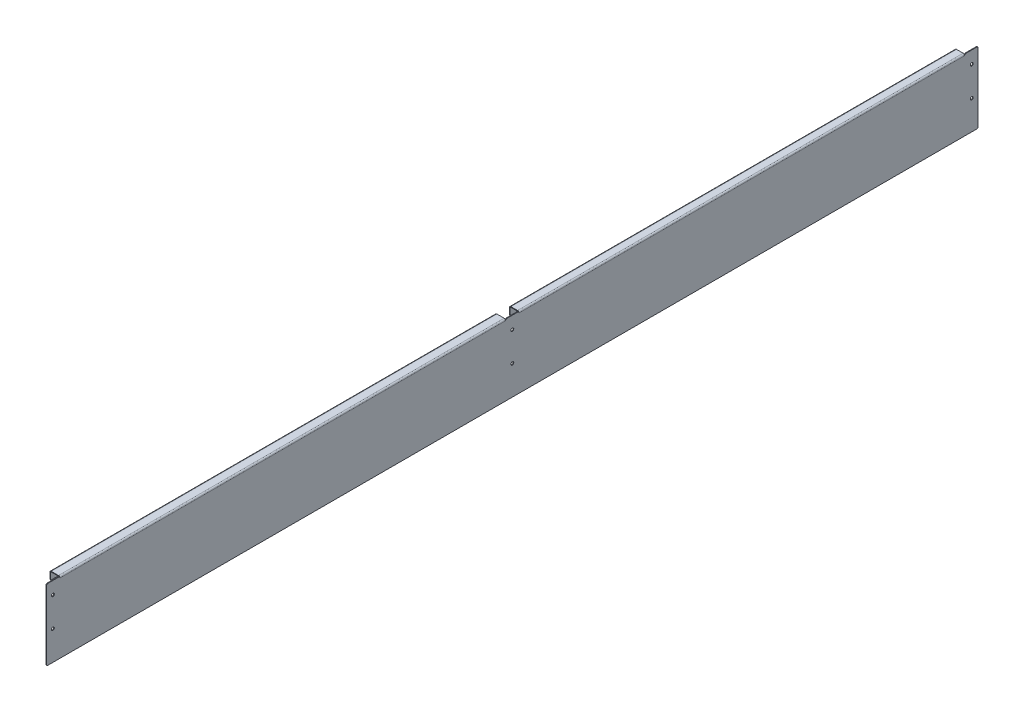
ISO-10303-21;
HEADER;
FILE_DESCRIPTION(('STEP AP214'),'2;1');
FILE_NAME('part.step','',(''),(''),'','','');
FILE_SCHEMA(('AUTOMOTIVE_DESIGN { 1 0 10303 214 1 1 1 1 }'));
ENDSEC;
DATA;
#1=APPLICATION_CONTEXT('core data for automotive mechanical design processes');
#2=APPLICATION_PROTOCOL_DEFINITION('international standard','automotive_design',2000,#1);
#3=PRODUCT_CONTEXT('',#1,'mechanical');
#4=PRODUCT('Part','Part','',(#3));
#5=PRODUCT_RELATED_PRODUCT_CATEGORY('part','',(#4));
#6=PRODUCT_DEFINITION_FORMATION('','',#4);
#7=PRODUCT_DEFINITION_CONTEXT('part definition',#1,'design');
#8=PRODUCT_DEFINITION('design','',#6,#7);
#9=PRODUCT_DEFINITION_SHAPE('','',#8);
#10=(LENGTH_UNIT() NAMED_UNIT(*) SI_UNIT(.MILLI.,.METRE.));
#11=(NAMED_UNIT(*) PLANE_ANGLE_UNIT() SI_UNIT($,.RADIAN.));
#12=(NAMED_UNIT(*) SI_UNIT($,.STERADIAN.) SOLID_ANGLE_UNIT());
#13=UNCERTAINTY_MEASURE_WITH_UNIT(LENGTH_MEASURE(1.E-05),#10,'distance_accuracy_value','');
#14=(GEOMETRIC_REPRESENTATION_CONTEXT(3) GLOBAL_UNCERTAINTY_ASSIGNED_CONTEXT((#13)) GLOBAL_UNIT_ASSIGNED_CONTEXT((#10,
#11,#12)) REPRESENTATION_CONTEXT('',''));
#15=CARTESIAN_POINT('',(0.,0.,0.));
#16=DIRECTION('',(0.,0.,1.));
#17=DIRECTION('',(1.,0.,0.));
#18=AXIS2_PLACEMENT_3D('',#15,#16,#17);
#19=CARTESIAN_POINT('',(-1.49999999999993,85.,16.));
#20=DIRECTION('',(0.,0.,-1.));
#21=DIRECTION('',(0.,1.,0.));
#22=AXIS2_PLACEMENT_3D('',#19,#20,#21);
#23=PLANE('',#22);
#24=DIRECTION('',(-1.,0.,0.));
#25=VECTOR('',#24,1.);
#26=CARTESIAN_POINT('',(3.0772486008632E-13,83.5,16.));
#27=LINE('',#26,#25);
#28=CARTESIAN_POINT('',(-21.,83.4999999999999,16.));
#29=VERTEX_POINT('',#28);
#30=CARTESIAN_POINT('',(-3.49999999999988,83.4999999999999,16.));
#31=VERTEX_POINT('',#30);
#32=EDGE_CURVE('E604',#29,#31,#27,.F.);
#33=ORIENTED_EDGE('',*,*,#32,.F.);
#34=DIRECTION('',(0.,1.,0.));
#35=VECTOR('',#34,1.);
#36=CARTESIAN_POINT('',(-21.,83.4999999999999,16.));
#37=LINE('',#36,#35);
#38=CARTESIAN_POINT('',(-21.,85.,16.));
#39=VERTEX_POINT('',#38);
#40=EDGE_CURVE('E463',#29,#39,#37,.T.);
#41=ORIENTED_EDGE('',*,*,#40,.T.);
#42=DIRECTION('',(1.,0.,0.));
#43=VECTOR('',#42,1.);
#44=CARTESIAN_POINT('',(-1.49999999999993,85.,16.));
#45=LINE('',#44,#43);
#46=CARTESIAN_POINT('',(-3.49999999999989,85.,16.));
#47=VERTEX_POINT('',#46);
#48=EDGE_CURVE('E598',#39,#47,#45,.T.);
#49=ORIENTED_EDGE('',*,*,#48,.T.);
#50=DIRECTION('',(0.,1.,0.));
#51=VECTOR('',#50,1.);
#52=CARTESIAN_POINT('',(-3.49999999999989,83.5,16.));
#53=LINE('',#52,#51);
#54=EDGE_CURVE('E612',#31,#47,#53,.T.);
#55=ORIENTED_EDGE('',*,*,#54,.F.);
#56=EDGE_LOOP('',(#33,#41,#49,#55));
#57=FACE_BOUND('',#56,.T.);
#58=ADVANCED_FACE('F115',(#57),#23,.T.);
#59=CARTESIAN_POINT('',(3.12962082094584E-13,85.,0.));
#60=DIRECTION('',(0.,1.,0.));
#61=DIRECTION('',(-1.,0.,0.));
#62=AXIS2_PLACEMENT_3D('',#59,#60,#61);
#63=PLANE('',#62);
#64=ORIENTED_EDGE('',*,*,#48,.F.);
#65=DIRECTION('',(0.,0.,-1.));
#66=VECTOR('',#65,1.);
#67=CARTESIAN_POINT('',(-21.,85.,16.));
#68=LINE('',#67,#66);
#69=CARTESIAN_POINT('',(-21.,84.9999999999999,1083.));
#70=VERTEX_POINT('',#69);
#71=EDGE_CURVE('E437',#39,#70,#68,.F.);
#72=ORIENTED_EDGE('',*,*,#71,.T.);
#73=DIRECTION('',(-1.,0.,0.));
#74=VECTOR('',#73,1.);
#75=CARTESIAN_POINT('',(-24.5,84.9999999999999,1083.));
#76=LINE('',#75,#74);
#77=CARTESIAN_POINT('',(-3.49999999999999,84.9999999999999,1083.));
#78=VERTEX_POINT('',#77);
#79=EDGE_CURVE('E601',#78,#70,#76,.T.);
#80=ORIENTED_EDGE('',*,*,#79,.F.);
#81=DIRECTION('',(0.,0.,-1.));
#82=VECTOR('',#81,1.);
#83=CARTESIAN_POINT('',(-3.49999999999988,85.,0.));
#84=LINE('',#83,#82);
#85=EDGE_CURVE('E609',#78,#47,#84,.T.);
#86=ORIENTED_EDGE('',*,*,#85,.T.);
#87=EDGE_LOOP('',(#64,#72,#80,#86));
#88=FACE_BOUND('',#87,.T.);
#89=ADVANCED_FACE('F990',(#88),#63,.T.);
#90=CARTESIAN_POINT('',(3.0772486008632E-13,83.5,0.));
#91=DIRECTION('',(0.,1.,0.));
#92=DIRECTION('',(-1.,0.,0.));
#93=AXIS2_PLACEMENT_3D('',#90,#91,#92);
#94=PLANE('',#93);
#95=DIRECTION('',(0.,0.,-1.));
#96=VECTOR('',#95,1.);
#97=CARTESIAN_POINT('',(-21.,83.4999999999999,16.));
#98=LINE('',#97,#96);
#99=CARTESIAN_POINT('',(-21.,83.4999999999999,1083.));
#100=VERTEX_POINT('',#99);
#101=EDGE_CURVE('E467',#29,#100,#98,.F.);
#102=ORIENTED_EDGE('',*,*,#101,.F.);
#103=ORIENTED_EDGE('',*,*,#32,.T.);
#104=DIRECTION('',(0.,0.,1.));
#105=VECTOR('',#104,1.);
#106=CARTESIAN_POINT('',(-3.49999999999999,83.4999999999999,1083.));
#107=LINE('',#106,#105);
#108=CARTESIAN_POINT('',(-3.5,83.4999999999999,1083.));
#109=VERTEX_POINT('',#108);
#110=EDGE_CURVE('E615',#109,#31,#107,.F.);
#111=ORIENTED_EDGE('',*,*,#110,.F.);
#112=DIRECTION('',(1.,0.,0.));
#113=VECTOR('',#112,1.);
#114=CARTESIAN_POINT('',(3.07724860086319E-13,83.4999999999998,1083.));
#115=LINE('',#114,#113);
#116=EDGE_CURVE('E606',#109,#100,#115,.F.);
#117=ORIENTED_EDGE('',*,*,#116,.T.);
#118=EDGE_LOOP('',(#102,#103,#111,#117));
#119=FACE_BOUND('',#118,.T.);
#120=ADVANCED_FACE('F996',(#119),#94,.F.);
#121=CARTESIAN_POINT('',(-23.,85.0000000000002,-1083.));
#122=DIRECTION('',(0.,0.,1.));
#123=DIRECTION('',(0.,-1.,0.));
#124=AXIS2_PLACEMENT_3D('',#121,#122,#123);
#125=PLANE('',#124);
#126=DIRECTION('',(0.,1.,0.));
#127=VECTOR('',#126,1.);
#128=CARTESIAN_POINT('',(-19.5,83.5000000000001,-1083.));
#129=LINE('',#128,#127);
#130=CARTESIAN_POINT('',(-19.5,83.5000000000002,-1083.));
#131=VERTEX_POINT('',#130);
#132=CARTESIAN_POINT('',(-19.5,85.0000000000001,-1083.));
#133=VERTEX_POINT('',#132);
#134=EDGE_CURVE('E509',#131,#133,#129,.T.);
#135=ORIENTED_EDGE('',*,*,#134,.T.);
#136=DIRECTION('',(-1.,0.,0.));
#137=VECTOR('',#136,1.);
#138=CARTESIAN_POINT('',(2.79565585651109E-13,85.0000000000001,-1083.));
#139=LINE('',#138,#137);
#140=CARTESIAN_POINT('',(-3.49999999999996,85.0000000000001,-1083.));
#141=VERTEX_POINT('',#140);
#142=EDGE_CURVE('E529',#141,#133,#139,.T.);
#143=ORIENTED_EDGE('',*,*,#142,.F.);
#144=DIRECTION('',(0.,-1.,0.));
#145=VECTOR('',#144,1.);
#146=CARTESIAN_POINT('',(-3.49999999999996,83.5000000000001,-1083.));
#147=LINE('',#146,#145);
#148=CARTESIAN_POINT('',(-3.49999999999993,83.5,-1083.));
#149=VERTEX_POINT('',#148);
#150=EDGE_CURVE('E539',#149,#141,#147,.F.);
#151=ORIENTED_EDGE('',*,*,#150,.F.);
#152=DIRECTION('',(1.,0.,0.));
#153=VECTOR('',#152,1.);
#154=CARTESIAN_POINT('',(-23.,83.5000000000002,-1083.));
#155=LINE('',#154,#153);
#156=EDGE_CURVE('E533',#149,#131,#155,.F.);
#157=ORIENTED_EDGE('',*,*,#156,.T.);
#158=EDGE_LOOP('',(#135,#143,#151,#157));
#159=FACE_BOUND('',#158,.T.);
#160=ADVANCED_FACE('F936',(#159),#125,.F.);
#161=CARTESIAN_POINT('',(-1.4999999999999,85.,-16.));
#162=DIRECTION('',(0.,0.,-1.));
#163=DIRECTION('',(0.,1.,0.));
#164=AXIS2_PLACEMENT_3D('',#161,#162,#163);
#165=PLANE('',#164);
#166=DIRECTION('',(0.,1.,0.));
#167=VECTOR('',#166,1.);
#168=CARTESIAN_POINT('',(-19.5,83.5000000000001,-16.));
#169=LINE('',#168,#167);
#170=CARTESIAN_POINT('',(-19.5,83.5000000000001,-16.));
#171=VERTEX_POINT('',#170);
#172=CARTESIAN_POINT('',(-19.5,85.,-16.));
#173=VERTEX_POINT('',#172);
#174=EDGE_CURVE('E520',#171,#173,#169,.T.);
#175=ORIENTED_EDGE('',*,*,#174,.F.);
#176=DIRECTION('',(-1.,0.,0.));
#177=VECTOR('',#176,1.);
#178=CARTESIAN_POINT('',(-1.4999999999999,83.5,-16.));
#179=LINE('',#178,#177);
#180=CARTESIAN_POINT('',(-3.49999999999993,83.5,-16.));
#181=VERTEX_POINT('',#180);
#182=EDGE_CURVE('E531',#171,#181,#179,.F.);
#183=ORIENTED_EDGE('',*,*,#182,.T.);
#184=DIRECTION('',(0.,-1.,0.));
#185=VECTOR('',#184,1.);
#186=CARTESIAN_POINT('',(-3.49999999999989,85.,-16.));
#187=LINE('',#186,#185);
#188=CARTESIAN_POINT('',(-3.49999999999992,85.,-16.));
#189=VERTEX_POINT('',#188);
#190=EDGE_CURVE('E523',#181,#189,#187,.F.);
#191=ORIENTED_EDGE('',*,*,#190,.T.);
#192=DIRECTION('',(1.,0.,0.));
#193=VECTOR('',#192,1.);
#194=CARTESIAN_POINT('',(2.79565585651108E-13,85.,-16.));
#195=LINE('',#194,#193);
#196=EDGE_CURVE('E526',#173,#189,#195,.T.);
#197=ORIENTED_EDGE('',*,*,#196,.F.);
#198=EDGE_LOOP('',(#175,#183,#191,#197));
#199=FACE_BOUND('',#198,.T.);
#200=ADVANCED_FACE('F973',(#199),#165,.F.);
#201=CARTESIAN_POINT('',(2.79565585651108E-13,85.,0.));
#202=DIRECTION('',(0.,-1.,0.));
#203=DIRECTION('',(1.,0.,0.));
#204=AXIS2_PLACEMENT_3D('',#201,#202,#203);
#205=PLANE('',#204);
#206=DIRECTION('',(0.,0.,-1.));
#207=VECTOR('',#206,1.);
#208=CARTESIAN_POINT('',(-19.5,85.0000000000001,-1083.));
#209=LINE('',#208,#207);
#210=EDGE_CURVE('E503',#133,#173,#209,.F.);
#211=ORIENTED_EDGE('',*,*,#210,.T.);
#212=ORIENTED_EDGE('',*,*,#196,.T.);
#213=DIRECTION('',(0.,0.,-1.));
#214=VECTOR('',#213,1.);
#215=CARTESIAN_POINT('',(-3.49999999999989,85.,-16.));
#216=LINE('',#215,#214);
#217=EDGE_CURVE('E536',#141,#189,#216,.F.);
#218=ORIENTED_EDGE('',*,*,#217,.F.);
#219=ORIENTED_EDGE('',*,*,#142,.T.);
#220=EDGE_LOOP('',(#211,#212,#218,#219));
#221=FACE_BOUND('',#220,.T.);
#222=ADVANCED_FACE('F934',(#221),#205,.F.);
#223=CARTESIAN_POINT('',(2.74328363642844E-13,83.5,0.));
#224=DIRECTION('',(0.,-1.,0.));
#225=DIRECTION('',(1.,0.,0.));
#226=AXIS2_PLACEMENT_3D('',#223,#224,#225);
#227=PLANE('',#226);
#228=ORIENTED_EDGE('',*,*,#182,.F.);
#229=DIRECTION('',(0.,0.,-1.));
#230=VECTOR('',#229,1.);
#231=CARTESIAN_POINT('',(-19.5,83.5000000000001,-1083.));
#232=LINE('',#231,#230);
#233=EDGE_CURVE('E515',#131,#171,#232,.F.);
#234=ORIENTED_EDGE('',*,*,#233,.F.);
#235=ORIENTED_EDGE('',*,*,#156,.F.);
#236=DIRECTION('',(0.,0.,-1.));
#237=VECTOR('',#236,1.);
#238=CARTESIAN_POINT('',(-3.49999999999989,83.5,-16.));
#239=LINE('',#238,#237);
#240=EDGE_CURVE('E542',#181,#149,#239,.T.);
#241=ORIENTED_EDGE('',*,*,#240,.F.);
#242=EDGE_LOOP('',(#228,#234,#235,#241));
#243=FACE_BOUND('',#242,.T.);
#244=ADVANCED_FACE('F969',(#243),#227,.T.);
#245=CARTESIAN_POINT('',(-1.5,85.0000000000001,-1115.));
#246=DIRECTION('',(0.,1.,0.));
#247=DIRECTION('',(0.,0.,1.));
#248=AXIS2_PLACEMENT_3D('',#245,#246,#247);
#249=PLANE('',#248);
#250=DIRECTION('',(0.,0.,1.));
#251=VECTOR('',#250,1.);
#252=CARTESIAN_POINT('',(0.,85.0000000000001,-1115.));
#253=LINE('',#252,#251);
#254=CARTESIAN_POINT('',(0.,85.0000000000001,-1112.));
#255=VERTEX_POINT('',#254);
#256=CARTESIAN_POINT('',(0.,85.0000000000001,-1086.15));
#257=VERTEX_POINT('',#256);
#258=EDGE_CURVE('E712',#255,#257,#253,.T.);
#259=ORIENTED_EDGE('',*,*,#258,.F.);
#260=DIRECTION('',(1.,0.,0.));
#261=VECTOR('',#260,1.);
#262=CARTESIAN_POINT('',(-1.5,85.0000000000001,-1112.));
#263=LINE('',#262,#261);
#264=CARTESIAN_POINT('',(-1.5,85.0000000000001,-1112.));
#265=VERTEX_POINT('',#264);
#266=EDGE_CURVE('E819',#255,#265,#263,.F.);
#267=ORIENTED_EDGE('',*,*,#266,.T.);
#268=DIRECTION('',(0.,0.,1.));
#269=VECTOR('',#268,1.);
#270=CARTESIAN_POINT('',(-1.5,85.0000000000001,-1115.));
#271=LINE('',#270,#269);
#272=CARTESIAN_POINT('',(-1.5,85.0000000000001,-1086.15));
#273=VERTEX_POINT('',#272);
#274=EDGE_CURVE('E722',#265,#273,#271,.T.);
#275=ORIENTED_EDGE('',*,*,#274,.T.);
#276=DIRECTION('',(1.,0.,0.));
#277=VECTOR('',#276,1.);
#278=CARTESIAN_POINT('',(-1.5,85.0000000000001,-1086.15));
#279=LINE('',#278,#277);
#280=EDGE_CURVE('E816',#273,#257,#279,.T.);
#281=ORIENTED_EDGE('',*,*,#280,.T.);
#282=EDGE_LOOP('',(#259,#267,#275,#281));
#283=FACE_BOUND('',#282,.T.);
#284=ADVANCED_FACE('F900',(#283),#249,.T.);
#285=CARTESIAN_POINT('',(0.,85.,-12.85));
#286=VERTEX_POINT('',#285);
#287=CARTESIAN_POINT('',(0.,85.,12.85));
#288=VERTEX_POINT('',#287);
#289=EDGE_CURVE('E734',#286,#288,#253,.T.);
#290=ORIENTED_EDGE('',*,*,#289,.F.);
#291=DIRECTION('',(1.,0.,0.));
#292=VECTOR('',#291,1.);
#293=CARTESIAN_POINT('',(-1.50000000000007,85.,-12.85));
#294=LINE('',#293,#292);
#295=CARTESIAN_POINT('',(-1.5,85.,-12.85));
#296=VERTEX_POINT('',#295);
#297=EDGE_CURVE('E860',#286,#296,#294,.F.);
#298=ORIENTED_EDGE('',*,*,#297,.T.);
#299=CARTESIAN_POINT('',(-1.5,85.,12.85));
#300=VERTEX_POINT('',#299);
#301=EDGE_CURVE('E719',#296,#300,#271,.T.);
#302=ORIENTED_EDGE('',*,*,#301,.T.);
#303=DIRECTION('',(1.,0.,0.));
#304=VECTOR('',#303,1.);
#305=CARTESIAN_POINT('',(-1.50000000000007,85.,12.85));
#306=LINE('',#305,#304);
#307=EDGE_CURVE('E857',#300,#288,#306,.T.);
#308=ORIENTED_EDGE('',*,*,#307,.T.);
#309=EDGE_LOOP('',(#290,#298,#302,#308));
#310=FACE_BOUND('',#309,.T.);
#311=ADVANCED_FACE('F1071',(#310),#249,.T.);
#312=CARTESIAN_POINT('',(-1.5,0.,0.));
#313=DIRECTION('',(1.,0.,0.));
#314=DIRECTION('',(0.,0.,-1.));
#315=AXIS2_PLACEMENT_3D('',#312,#313,#314);
#316=PLANE('',#315);
#317=CARTESIAN_POINT('',(-1.5,-14.9999999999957,-1100.));
#318=DIRECTION('',(1.,0.,0.));
#319=DIRECTION('',(0.,0.,-1.));
#320=AXIS2_PLACEMENT_3D('',#317,#318,#319);
#321=CIRCLE('',#320,3.49999999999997);
#322=CARTESIAN_POINT('',(-1.5,-14.9999999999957,-1103.5));
#323=VERTEX_POINT('',#322);
#324=EDGE_CURVE('E672',#323,#323,#321,.T.);
#325=ORIENTED_EDGE('',*,*,#324,.T.);
#326=EDGE_LOOP('',(#325));
#327=FACE_BOUND('',#326,.T.);
#328=CARTESIAN_POINT('',(-1.5,54.9999999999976,1100.));
#329=DIRECTION('',(1.,0.,0.));
#330=DIRECTION('',(0.,0.,-1.));
#331=AXIS2_PLACEMENT_3D('',#328,#329,#330);
#332=CIRCLE('',#331,3.49999999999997);
#333=CARTESIAN_POINT('',(-1.5,54.9999999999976,1096.5));
#334=VERTEX_POINT('',#333);
#335=EDGE_CURVE('E679',#334,#334,#332,.T.);
#336=ORIENTED_EDGE('',*,*,#335,.T.);
#337=EDGE_LOOP('',(#336));
#338=FACE_BOUND('',#337,.T.);
#339=CARTESIAN_POINT('',(-1.5,-14.9999999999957,1100.));
#340=DIRECTION('',(1.,0.,0.));
#341=DIRECTION('',(0.,0.,-1.));
#342=AXIS2_PLACEMENT_3D('',#339,#340,#341);
#343=CIRCLE('',#342,3.49999999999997);
#344=CARTESIAN_POINT('',(-1.5,-14.9999999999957,1096.5));
#345=VERTEX_POINT('',#344);
#346=EDGE_CURVE('E685',#345,#345,#343,.T.);
#347=ORIENTED_EDGE('',*,*,#346,.T.);
#348=EDGE_LOOP('',(#347));
#349=FACE_BOUND('',#348,.T.);
#350=CARTESIAN_POINT('',(-1.5,-14.9999999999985,0.));
#351=DIRECTION('',(1.,0.,0.));
#352=DIRECTION('',(0.,0.,-1.));
#353=AXIS2_PLACEMENT_3D('',#350,#351,#352);
#354=CIRCLE('',#353,3.49999999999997);
#355=CARTESIAN_POINT('',(-1.5,-14.9999999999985,-3.49999999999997));
#356=VERTEX_POINT('',#355);
#357=EDGE_CURVE('E691',#356,#356,#354,.T.);
#358=ORIENTED_EDGE('',*,*,#357,.T.);
#359=EDGE_LOOP('',(#358));
#360=FACE_BOUND('',#359,.T.);
#361=CARTESIAN_POINT('',(-1.5,54.9999999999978,0.));
#362=DIRECTION('',(1.,0.,0.));
#363=DIRECTION('',(0.,0.,-1.));
#364=AXIS2_PLACEMENT_3D('',#361,#362,#363);
#365=CIRCLE('',#364,3.49999999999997);
#366=CARTESIAN_POINT('',(-1.5,54.9999999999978,-3.49999999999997));
#367=VERTEX_POINT('',#366);
#368=EDGE_CURVE('E697',#367,#367,#365,.T.);
#369=ORIENTED_EDGE('',*,*,#368,.T.);
#370=EDGE_LOOP('',(#369));
#371=FACE_BOUND('',#370,.T.);
#372=CARTESIAN_POINT('',(-1.5,54.9999999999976,-1100.));
#373=DIRECTION('',(1.,0.,0.));
#374=DIRECTION('',(0.,0.,-1.));
#375=AXIS2_PLACEMENT_3D('',#372,#373,#374);
#376=CIRCLE('',#375,3.49999999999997);
#377=CARTESIAN_POINT('',(-1.5,54.9999999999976,-1103.5));
#378=VERTEX_POINT('',#377);
#379=EDGE_CURVE('E702',#378,#378,#376,.T.);
#380=ORIENTED_EDGE('',*,*,#379,.T.);
#381=EDGE_LOOP('',(#380));
#382=FACE_BOUND('',#381,.T.);
#383=DIRECTION('',(0.,0.,-1.));
#384=VECTOR('',#383,1.);
#385=CARTESIAN_POINT('',(-1.5,-84.9999999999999,-1115.));
#386=LINE('',#385,#384);
#387=CARTESIAN_POINT('',(-1.5,-85.0000000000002,1112.));
#388=VERTEX_POINT('',#387);
#389=CARTESIAN_POINT('',(-1.5,-84.9999999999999,-1112.));
#390=VERTEX_POINT('',#389);
#391=EDGE_CURVE('E711',#388,#390,#386,.T.);
#392=ORIENTED_EDGE('',*,*,#391,.F.);
#393=CARTESIAN_POINT('',(-1.5,-82.0000000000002,1112.));
#394=DIRECTION('',(1.,0.,0.));
#395=DIRECTION('',(0.,0.,-1.));
#396=AXIS2_PLACEMENT_3D('',#393,#394,#395);
#397=CIRCLE('',#396,3.);
#398=CARTESIAN_POINT('',(-1.5,-82.0000000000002,1115.));
#399=VERTEX_POINT('',#398);
#400=EDGE_CURVE('E809',#388,#399,#397,.F.);
#401=ORIENTED_EDGE('',*,*,#400,.T.);
#402=DIRECTION('',(0.,-1.,0.));
#403=VECTOR('',#402,1.);
#404=CARTESIAN_POINT('',(-1.5,-85.0000000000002,1115.));
#405=LINE('',#404,#403);
#406=CARTESIAN_POINT('',(-1.5,81.9999999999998,1115.));
#407=VERTEX_POINT('',#406);
#408=EDGE_CURVE('E708',#407,#399,#405,.T.);
#409=ORIENTED_EDGE('',*,*,#408,.F.);
#410=CARTESIAN_POINT('',(-1.5,81.9999999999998,1112.));
#411=DIRECTION('',(1.,0.,0.));
#412=DIRECTION('',(0.,0.,-1.));
#413=AXIS2_PLACEMENT_3D('',#410,#411,#412);
#414=CIRCLE('',#413,3.);
#415=CARTESIAN_POINT('',(-1.5,84.9999999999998,1112.));
#416=VERTEX_POINT('',#415);
#417=EDGE_CURVE('E795',#407,#416,#414,.F.);
#418=ORIENTED_EDGE('',*,*,#417,.T.);
#419=CARTESIAN_POINT('',(-1.5,84.9999999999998,1086.15));
#420=VERTEX_POINT('',#419);
#421=EDGE_CURVE('E718',#420,#416,#271,.T.);
#422=ORIENTED_EDGE('',*,*,#421,.F.);
#423=CARTESIAN_POINT('',(-1.5,81.9999999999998,1086.15));
#424=DIRECTION('',(1.,0.,0.));
#425=DIRECTION('',(0.,0.,-1.));
#426=AXIS2_PLACEMENT_3D('',#423,#424,#425);
#427=CIRCLE('',#426,3.);
#428=CARTESIAN_POINT('',(-1.50000000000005,81.9999999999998,1083.15));
#429=VERTEX_POINT('',#428);
#430=EDGE_CURVE('E797',#420,#429,#427,.F.);
#431=ORIENTED_EDGE('',*,*,#430,.T.);
#432=DIRECTION('',(0.,1.,0.));
#433=VECTOR('',#432,1.);
#434=CARTESIAN_POINT('',(-1.50000000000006,81.35,1083.15));
#435=LINE('',#434,#433);
#436=CARTESIAN_POINT('',(-1.50000000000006,81.35,1083.15));
#437=VERTEX_POINT('',#436);
#438=EDGE_CURVE('E661',#437,#429,#435,.T.);
#439=ORIENTED_EDGE('',*,*,#438,.F.);
#440=DIRECTION('',(0.,0.,1.));
#441=VECTOR('',#440,1.);
#442=CARTESIAN_POINT('',(-1.50000000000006,81.35,1083.));
#443=LINE('',#442,#441);
#444=CARTESIAN_POINT('',(-1.50000000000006,81.35,1083.));
#445=VERTEX_POINT('',#444);
#446=EDGE_CURVE('E657',#445,#437,#443,.T.);
#447=ORIENTED_EDGE('',*,*,#446,.F.);
#448=DIRECTION('',(0.,-1.,0.));
#449=VECTOR('',#448,1.);
#450=CARTESIAN_POINT('',(-1.50000000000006,81.5,1083.));
#451=LINE('',#450,#449);
#452=CARTESIAN_POINT('',(-1.50000000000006,81.5,1083.));
#453=VERTEX_POINT('',#452);
#454=EDGE_CURVE('E654',#453,#445,#451,.T.);
#455=ORIENTED_EDGE('',*,*,#454,.F.);
#456=DIRECTION('',(0.,0.,-1.));
#457=VECTOR('',#456,1.);
#458=CARTESIAN_POINT('',(-1.49999999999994,81.5,16.));
#459=LINE('',#458,#457);
#460=CARTESIAN_POINT('',(-1.49999999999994,81.5,16.));
#461=VERTEX_POINT('',#460);
#462=EDGE_CURVE('E633',#461,#453,#459,.F.);
#463=ORIENTED_EDGE('',*,*,#462,.F.);
#464=DIRECTION('',(0.,1.,0.));
#465=VECTOR('',#464,1.);
#466=CARTESIAN_POINT('',(-1.49999999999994,81.35,16.));
#467=LINE('',#466,#465);
#468=CARTESIAN_POINT('',(-1.49999999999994,81.35,16.));
#469=VERTEX_POINT('',#468);
#470=EDGE_CURVE('E650',#469,#461,#467,.T.);
#471=ORIENTED_EDGE('',*,*,#470,.F.);
#472=DIRECTION('',(0.,0.,1.));
#473=VECTOR('',#472,1.);
#474=CARTESIAN_POINT('',(-1.49999999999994,81.35,15.85));
#475=LINE('',#474,#473);
#476=CARTESIAN_POINT('',(-1.49999999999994,81.35,15.85));
#477=VERTEX_POINT('',#476);
#478=EDGE_CURVE('E646',#477,#469,#475,.T.);
#479=ORIENTED_EDGE('',*,*,#478,.F.);
#480=DIRECTION('',(0.,-1.,0.));
#481=VECTOR('',#480,1.);
#482=CARTESIAN_POINT('',(-1.49999999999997,85.,15.85));
#483=LINE('',#482,#481);
#484=CARTESIAN_POINT('',(-1.49999999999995,82.,15.85));
#485=VERTEX_POINT('',#484);
#486=EDGE_CURVE('E643',#485,#477,#483,.T.);
#487=ORIENTED_EDGE('',*,*,#486,.F.);
#488=CARTESIAN_POINT('',(-1.5,82.,12.85));
#489=DIRECTION('',(1.,0.,0.));
#490=DIRECTION('',(0.,0.,-1.));
#491=AXIS2_PLACEMENT_3D('',#488,#489,#490);
#492=CIRCLE('',#491,3.);
#493=EDGE_CURVE('E799',#485,#300,#492,.F.);
#494=ORIENTED_EDGE('',*,*,#493,.T.);
#495=ORIENTED_EDGE('',*,*,#301,.F.);
#496=CARTESIAN_POINT('',(-1.5,82.,-12.85));
#497=DIRECTION('',(1.,0.,0.));
#498=DIRECTION('',(0.,0.,-1.));
#499=AXIS2_PLACEMENT_3D('',#496,#497,#498);
#500=CIRCLE('',#499,3.);
#501=CARTESIAN_POINT('',(-1.5,82.,-15.85));
#502=VERTEX_POINT('',#501);
#503=EDGE_CURVE('E801',#296,#502,#500,.F.);
#504=ORIENTED_EDGE('',*,*,#503,.T.);
#505=DIRECTION('',(0.,1.,0.));
#506=VECTOR('',#505,1.);
#507=CARTESIAN_POINT('',(-1.5,81.3500000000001,-15.85));
#508=LINE('',#507,#506);
#509=CARTESIAN_POINT('',(-1.5,81.3500000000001,-15.85));
#510=VERTEX_POINT('',#509);
#511=EDGE_CURVE('E587',#510,#502,#508,.T.);
#512=ORIENTED_EDGE('',*,*,#511,.F.);
#513=DIRECTION('',(0.,0.,1.));
#514=VECTOR('',#513,1.);
#515=CARTESIAN_POINT('',(-1.5,81.3500000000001,-16.));
#516=LINE('',#515,#514);
#517=CARTESIAN_POINT('',(-1.5,81.3500000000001,-16.));
#518=VERTEX_POINT('',#517);
#519=EDGE_CURVE('E583',#518,#510,#516,.T.);
#520=ORIENTED_EDGE('',*,*,#519,.F.);
#521=DIRECTION('',(0.,-1.,0.));
#522=VECTOR('',#521,1.);
#523=CARTESIAN_POINT('',(-1.5,81.5000000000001,-16.));
#524=LINE('',#523,#522);
#525=CARTESIAN_POINT('',(-1.5,81.5000000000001,-16.));
#526=VERTEX_POINT('',#525);
#527=EDGE_CURVE('E580',#526,#518,#524,.T.);
#528=ORIENTED_EDGE('',*,*,#527,.F.);
#529=DIRECTION('',(0.,0.,-1.));
#530=VECTOR('',#529,1.);
#531=CARTESIAN_POINT('',(-1.5,81.5000000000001,-1083.));
#532=LINE('',#531,#530);
#533=CARTESIAN_POINT('',(-1.5,81.5000000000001,-1083.));
#534=VERTEX_POINT('',#533);
#535=EDGE_CURVE('E559',#534,#526,#532,.F.);
#536=ORIENTED_EDGE('',*,*,#535,.F.);
#537=DIRECTION('',(0.,1.,0.));
#538=VECTOR('',#537,1.);
#539=CARTESIAN_POINT('',(-1.5,81.3500000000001,-1083.));
#540=LINE('',#539,#538);
#541=CARTESIAN_POINT('',(-1.5,81.3500000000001,-1083.));
#542=VERTEX_POINT('',#541);
#543=EDGE_CURVE('E576',#542,#534,#540,.T.);
#544=ORIENTED_EDGE('',*,*,#543,.F.);
#545=DIRECTION('',(0.,0.,1.));
#546=VECTOR('',#545,1.);
#547=CARTESIAN_POINT('',(-1.5,81.3500000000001,-1083.15));
#548=LINE('',#547,#546);
#549=CARTESIAN_POINT('',(-1.5,81.3500000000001,-1083.15));
#550=VERTEX_POINT('',#549);
#551=EDGE_CURVE('E572',#550,#542,#548,.T.);
#552=ORIENTED_EDGE('',*,*,#551,.F.);
#553=DIRECTION('',(0.,-1.,0.));
#554=VECTOR('',#553,1.);
#555=CARTESIAN_POINT('',(-1.5,85.0000000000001,-1083.15));
#556=LINE('',#555,#554);
#557=CARTESIAN_POINT('',(-1.5,82.0000000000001,-1083.15));
#558=VERTEX_POINT('',#557);
#559=EDGE_CURVE('E569',#558,#550,#556,.T.);
#560=ORIENTED_EDGE('',*,*,#559,.F.);
#561=CARTESIAN_POINT('',(-1.5,82.0000000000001,-1086.15));
#562=DIRECTION('',(1.,0.,0.));
#563=DIRECTION('',(0.,0.,-1.));
#564=AXIS2_PLACEMENT_3D('',#561,#562,#563);
#565=CIRCLE('',#564,3.);
#566=EDGE_CURVE('E803',#558,#273,#565,.F.);
#567=ORIENTED_EDGE('',*,*,#566,.T.);
#568=ORIENTED_EDGE('',*,*,#274,.F.);
#569=CARTESIAN_POINT('',(-1.5,82.0000000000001,-1112.));
#570=DIRECTION('',(1.,0.,0.));
#571=DIRECTION('',(0.,0.,-1.));
#572=AXIS2_PLACEMENT_3D('',#569,#570,#571);
#573=CIRCLE('',#572,3.);
#574=CARTESIAN_POINT('',(-1.5,82.0000000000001,-1115.));
#575=VERTEX_POINT('',#574);
#576=EDGE_CURVE('E805',#265,#575,#573,.F.);
#577=ORIENTED_EDGE('',*,*,#576,.T.);
#578=DIRECTION('',(0.,1.,0.));
#579=VECTOR('',#578,1.);
#580=CARTESIAN_POINT('',(-1.5,-84.9999999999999,-1115.));
#581=LINE('',#580,#579);
#582=CARTESIAN_POINT('',(-1.5,-81.9999999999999,-1115.));
#583=VERTEX_POINT('',#582);
#584=EDGE_CURVE('E715',#583,#575,#581,.T.);
#585=ORIENTED_EDGE('',*,*,#584,.F.);
#586=CARTESIAN_POINT('',(-1.5,-81.9999999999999,-1112.));
#587=DIRECTION('',(1.,0.,0.));
#588=DIRECTION('',(0.,0.,-1.));
#589=AXIS2_PLACEMENT_3D('',#586,#587,#588);
#590=CIRCLE('',#589,3.);
#591=EDGE_CURVE('E807',#583,#390,#590,.F.);
#592=ORIENTED_EDGE('',*,*,#591,.T.);
#593=EDGE_LOOP('',(#392,#401,#409,#418,#422,#431,#439,#447,#455,#463,#471,#479,#487,#494,#495,
#504,#512,#520,#528,#536,#544,#552,#560,#567,#568,#577,#585,#592));
#594=FACE_BOUND('',#593,.T.);
#595=ADVANCED_FACE('F892',(#327,#338,#349,#360,#371,#382,#594),#316,.F.);
#596=CARTESIAN_POINT('',(0.,0.,0.));
#597=DIRECTION('',(1.,0.,0.));
#598=DIRECTION('',(0.,0.,-1.));
#599=AXIS2_PLACEMENT_3D('',#596,#597,#598);
#600=PLANE('',#599);
#601=CARTESIAN_POINT('',(0.,-14.9999999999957,-1100.));
#602=DIRECTION('',(1.,0.,0.));
#603=DIRECTION('',(0.,0.,-1.));
#604=AXIS2_PLACEMENT_3D('',#601,#602,#603);
#605=CIRCLE('',#604,3.49999999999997);
#606=CARTESIAN_POINT('',(0.,-14.9999999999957,-1103.5));
#607=VERTEX_POINT('',#606);
#608=EDGE_CURVE('E676',#607,#607,#605,.T.);
#609=ORIENTED_EDGE('',*,*,#608,.F.);
#610=EDGE_LOOP('',(#609));
#611=FACE_BOUND('',#610,.T.);
#612=CARTESIAN_POINT('',(0.,54.9999999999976,1100.));
#613=DIRECTION('',(1.,0.,0.));
#614=DIRECTION('',(0.,0.,-1.));
#615=AXIS2_PLACEMENT_3D('',#612,#613,#614);
#616=CIRCLE('',#615,3.49999999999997);
#617=CARTESIAN_POINT('',(0.,54.9999999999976,1096.5));
#618=VERTEX_POINT('',#617);
#619=EDGE_CURVE('E682',#618,#618,#616,.T.);
#620=ORIENTED_EDGE('',*,*,#619,.F.);
#621=EDGE_LOOP('',(#620));
#622=FACE_BOUND('',#621,.T.);
#623=CARTESIAN_POINT('',(0.,-14.9999999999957,1100.));
#624=DIRECTION('',(1.,0.,0.));
#625=DIRECTION('',(0.,0.,-1.));
#626=AXIS2_PLACEMENT_3D('',#623,#624,#625);
#627=CIRCLE('',#626,3.49999999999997);
#628=CARTESIAN_POINT('',(0.,-14.9999999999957,1096.5));
#629=VERTEX_POINT('',#628);
#630=EDGE_CURVE('E688',#629,#629,#627,.T.);
#631=ORIENTED_EDGE('',*,*,#630,.F.);
#632=EDGE_LOOP('',(#631));
#633=FACE_BOUND('',#632,.T.);
#634=CARTESIAN_POINT('',(0.,-14.9999999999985,0.));
#635=DIRECTION('',(1.,0.,0.));
#636=DIRECTION('',(0.,0.,-1.));
#637=AXIS2_PLACEMENT_3D('',#634,#635,#636);
#638=CIRCLE('',#637,3.49999999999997);
#639=CARTESIAN_POINT('',(0.,-14.9999999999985,-3.49999999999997));
#640=VERTEX_POINT('',#639);
#641=EDGE_CURVE('E694',#640,#640,#638,.T.);
#642=ORIENTED_EDGE('',*,*,#641,.F.);
#643=EDGE_LOOP('',(#642));
#644=FACE_BOUND('',#643,.T.);
#645=CARTESIAN_POINT('',(0.,54.9999999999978,0.));
#646=DIRECTION('',(1.,0.,0.));
#647=DIRECTION('',(0.,0.,-1.));
#648=AXIS2_PLACEMENT_3D('',#645,#646,#647);
#649=CIRCLE('',#648,3.49999999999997);
#650=CARTESIAN_POINT('',(0.,54.9999999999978,-3.49999999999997));
#651=VERTEX_POINT('',#650);
#652=EDGE_CURVE('E645',#651,#651,#649,.T.);
#653=ORIENTED_EDGE('',*,*,#652,.F.);
#654=EDGE_LOOP('',(#653));
#655=FACE_BOUND('',#654,.T.);
#656=CARTESIAN_POINT('',(0.,54.9999999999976,-1100.));
#657=DIRECTION('',(1.,0.,0.));
#658=DIRECTION('',(0.,0.,-1.));
#659=AXIS2_PLACEMENT_3D('',#656,#657,#658);
#660=CIRCLE('',#659,3.49999999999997);
#661=CARTESIAN_POINT('',(0.,54.9999999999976,-1103.5));
#662=VERTEX_POINT('',#661);
#663=EDGE_CURVE('E675',#662,#662,#660,.T.);
#664=ORIENTED_EDGE('',*,*,#663,.F.);
#665=EDGE_LOOP('',(#664));
#666=FACE_BOUND('',#665,.T.);
#667=DIRECTION('',(0.,-1.,0.));
#668=VECTOR('',#667,1.);
#669=CARTESIAN_POINT('',(0.,-85.0000000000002,1115.));
#670=LINE('',#669,#668);
#671=CARTESIAN_POINT('',(0.,81.9999999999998,1115.));
#672=VERTEX_POINT('',#671);
#673=CARTESIAN_POINT('',(0.,-82.0000000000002,1115.));
#674=VERTEX_POINT('',#673);
#675=EDGE_CURVE('E705',#672,#674,#670,.T.);
#676=ORIENTED_EDGE('',*,*,#675,.T.);
#677=CARTESIAN_POINT('',(0.,-82.0000000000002,1112.));
#678=DIRECTION('',(1.,0.,0.));
#679=DIRECTION('',(0.,0.,-1.));
#680=AXIS2_PLACEMENT_3D('',#677,#678,#679);
#681=CIRCLE('',#680,3.);
#682=CARTESIAN_POINT('',(0.,-85.0000000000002,1112.));
#683=VERTEX_POINT('',#682);
#684=EDGE_CURVE('E788',#674,#683,#681,.T.);
#685=ORIENTED_EDGE('',*,*,#684,.T.);
#686=DIRECTION('',(0.,0.,-1.));
#687=VECTOR('',#686,1.);
#688=CARTESIAN_POINT('',(0.,-84.9999999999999,-1115.));
#689=LINE('',#688,#687);
#690=CARTESIAN_POINT('',(0.,-84.9999999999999,-1112.));
#691=VERTEX_POINT('',#690);
#692=EDGE_CURVE('E725',#683,#691,#689,.T.);
#693=ORIENTED_EDGE('',*,*,#692,.T.);
#694=CARTESIAN_POINT('',(0.,-81.9999999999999,-1112.));
#695=DIRECTION('',(1.,0.,0.));
#696=DIRECTION('',(0.,0.,-1.));
#697=AXIS2_PLACEMENT_3D('',#694,#695,#696);
#698=CIRCLE('',#697,3.);
#699=CARTESIAN_POINT('',(0.,-81.9999999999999,-1115.));
#700=VERTEX_POINT('',#699);
#701=EDGE_CURVE('E786',#691,#700,#698,.T.);
#702=ORIENTED_EDGE('',*,*,#701,.T.);
#703=DIRECTION('',(0.,1.,0.));
#704=VECTOR('',#703,1.);
#705=CARTESIAN_POINT('',(0.,-84.9999999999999,-1115.));
#706=LINE('',#705,#704);
#707=CARTESIAN_POINT('',(0.,82.0000000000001,-1115.));
#708=VERTEX_POINT('',#707);
#709=EDGE_CURVE('E728',#700,#708,#706,.T.);
#710=ORIENTED_EDGE('',*,*,#709,.T.);
#711=CARTESIAN_POINT('',(0.,82.0000000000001,-1112.));
#712=DIRECTION('',(1.,0.,0.));
#713=DIRECTION('',(0.,0.,-1.));
#714=AXIS2_PLACEMENT_3D('',#711,#712,#713);
#715=CIRCLE('',#714,3.);
#716=EDGE_CURVE('E784',#708,#255,#715,.T.);
#717=ORIENTED_EDGE('',*,*,#716,.T.);
#718=ORIENTED_EDGE('',*,*,#258,.T.);
#719=CARTESIAN_POINT('',(0.,82.0000000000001,-1086.15));
#720=DIRECTION('',(1.,0.,0.));
#721=DIRECTION('',(0.,0.,-1.));
#722=AXIS2_PLACEMENT_3D('',#719,#720,#721);
#723=CIRCLE('',#722,3.);
#724=CARTESIAN_POINT('',(0.,82.0000000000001,-1083.15));
#725=VERTEX_POINT('',#724);
#726=EDGE_CURVE('E782',#257,#725,#723,.T.);
#727=ORIENTED_EDGE('',*,*,#726,.T.);
#728=DIRECTION('',(0.,-1.,0.));
#729=VECTOR('',#728,1.);
#730=CARTESIAN_POINT('',(0.,0.,-1083.15));
#731=LINE('',#730,#729);
#732=CARTESIAN_POINT('',(0.,81.3500000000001,-1083.15));
#733=VERTEX_POINT('',#732);
#734=EDGE_CURVE('E767',#725,#733,#731,.T.);
#735=ORIENTED_EDGE('',*,*,#734,.T.);
#736=DIRECTION('',(0.,0.,1.));
#737=VECTOR('',#736,1.);
#738=CARTESIAN_POINT('',(0.,81.3500000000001,0.));
#739=LINE('',#738,#737);
#740=CARTESIAN_POINT('',(0.,81.3500000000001,-1083.));
#741=VERTEX_POINT('',#740);
#742=EDGE_CURVE('E764',#733,#741,#739,.T.);
#743=ORIENTED_EDGE('',*,*,#742,.T.);
#744=DIRECTION('',(0.,1.,0.));
#745=VECTOR('',#744,1.);
#746=CARTESIAN_POINT('',(0.,0.,-1083.));
#747=LINE('',#746,#745);
#748=CARTESIAN_POINT('',(0.,81.5000000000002,-1083.));
#749=VERTEX_POINT('',#748);
#750=EDGE_CURVE('E761',#741,#749,#747,.T.);
#751=ORIENTED_EDGE('',*,*,#750,.T.);
#752=DIRECTION('',(0.,0.,-1.));
#753=VECTOR('',#752,1.);
#754=CARTESIAN_POINT('',(0.,81.5000000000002,-1083.));
#755=LINE('',#754,#753);
#756=CARTESIAN_POINT('',(0.,81.5000000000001,-16.));
#757=VERTEX_POINT('',#756);
#758=EDGE_CURVE('E546',#749,#757,#755,.F.);
#759=ORIENTED_EDGE('',*,*,#758,.T.);
#760=DIRECTION('',(0.,-1.,0.));
#761=VECTOR('',#760,1.);
#762=CARTESIAN_POINT('',(0.,0.,-16.));
#763=LINE('',#762,#761);
#764=CARTESIAN_POINT('',(0.,81.3500000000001,-16.));
#765=VERTEX_POINT('',#764);
#766=EDGE_CURVE('E758',#757,#765,#763,.T.);
#767=ORIENTED_EDGE('',*,*,#766,.T.);
#768=DIRECTION('',(0.,0.,1.));
#769=VECTOR('',#768,1.);
#770=CARTESIAN_POINT('',(0.,81.3500000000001,0.));
#771=LINE('',#770,#769);
#772=CARTESIAN_POINT('',(0.,81.3500000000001,-15.85));
#773=VERTEX_POINT('',#772);
#774=EDGE_CURVE('E755',#765,#773,#771,.T.);
#775=ORIENTED_EDGE('',*,*,#774,.T.);
#776=DIRECTION('',(0.,1.,0.));
#777=VECTOR('',#776,1.);
#778=CARTESIAN_POINT('',(0.,1.95857409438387E-13,-15.850000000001));
#779=LINE('',#778,#777);
#780=CARTESIAN_POINT('',(0.,82.,-15.85));
#781=VERTEX_POINT('',#780);
#782=EDGE_CURVE('E752',#773,#781,#779,.T.);
#783=ORIENTED_EDGE('',*,*,#782,.T.);
#784=CARTESIAN_POINT('',(0.,82.,-12.85));
#785=DIRECTION('',(1.,0.,0.));
#786=DIRECTION('',(0.,0.,-1.));
#787=AXIS2_PLACEMENT_3D('',#784,#785,#786);
#788=CIRCLE('',#787,3.);
#789=EDGE_CURVE('E780',#781,#286,#788,.T.);
#790=ORIENTED_EDGE('',*,*,#789,.T.);
#791=ORIENTED_EDGE('',*,*,#289,.T.);
#792=CARTESIAN_POINT('',(0.,82.,12.85));
#793=DIRECTION('',(1.,0.,0.));
#794=DIRECTION('',(0.,0.,-1.));
#795=AXIS2_PLACEMENT_3D('',#792,#793,#794);
#796=CIRCLE('',#795,3.);
#797=CARTESIAN_POINT('',(0.,82.,15.85));
#798=VERTEX_POINT('',#797);
#799=EDGE_CURVE('E778',#288,#798,#796,.T.);
#800=ORIENTED_EDGE('',*,*,#799,.T.);
#801=DIRECTION('',(0.,-1.,0.));
#802=VECTOR('',#801,1.);
#803=CARTESIAN_POINT('',(0.,1.95857409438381E-13,15.850000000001));
#804=LINE('',#803,#802);
#805=CARTESIAN_POINT('',(0.,81.35,15.85));
#806=VERTEX_POINT('',#805);
#807=EDGE_CURVE('E750',#798,#806,#804,.T.);
#808=ORIENTED_EDGE('',*,*,#807,.T.);
#809=DIRECTION('',(0.,0.,1.));
#810=VECTOR('',#809,1.);
#811=CARTESIAN_POINT('',(0.,81.35,0.));
#812=LINE('',#811,#810);
#813=CARTESIAN_POINT('',(0.,81.35,16.));
#814=VERTEX_POINT('',#813);
#815=EDGE_CURVE('E747',#806,#814,#812,.T.);
#816=ORIENTED_EDGE('',*,*,#815,.T.);
#817=DIRECTION('',(0.,1.,0.));
#818=VECTOR('',#817,1.);
#819=CARTESIAN_POINT('',(0.,0.,16.));
#820=LINE('',#819,#818);
#821=CARTESIAN_POINT('',(0.,81.5,16.));
#822=VERTEX_POINT('',#821);
#823=EDGE_CURVE('E744',#814,#822,#820,.T.);
#824=ORIENTED_EDGE('',*,*,#823,.T.);
#825=DIRECTION('',(0.,0.,-1.));
#826=VECTOR('',#825,1.);
#827=CARTESIAN_POINT('',(0.,81.5,16.));
#828=LINE('',#827,#826);
#829=CARTESIAN_POINT('',(0.,81.5,1083.));
#830=VERTEX_POINT('',#829);
#831=EDGE_CURVE('E620',#822,#830,#828,.F.);
#832=ORIENTED_EDGE('',*,*,#831,.T.);
#833=DIRECTION('',(0.,-1.,0.));
#834=VECTOR('',#833,1.);
#835=CARTESIAN_POINT('',(0.,0.,1083.));
#836=LINE('',#835,#834);
#837=CARTESIAN_POINT('',(0.,81.35,1083.));
#838=VERTEX_POINT('',#837);
#839=EDGE_CURVE('E741',#830,#838,#836,.T.);
#840=ORIENTED_EDGE('',*,*,#839,.T.);
#841=DIRECTION('',(0.,0.,1.));
#842=VECTOR('',#841,1.);
#843=CARTESIAN_POINT('',(0.,81.35,0.));
#844=LINE('',#843,#842);
#845=CARTESIAN_POINT('',(0.,81.35,1083.15));
#846=VERTEX_POINT('',#845);
#847=EDGE_CURVE('E738',#838,#846,#844,.T.);
#848=ORIENTED_EDGE('',*,*,#847,.T.);
#849=DIRECTION('',(0.,1.,0.));
#850=VECTOR('',#849,1.);
#851=CARTESIAN_POINT('',(0.,0.,1083.15));
#852=LINE('',#851,#850);
#853=CARTESIAN_POINT('',(0.,81.9999999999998,1083.15));
#854=VERTEX_POINT('',#853);
#855=EDGE_CURVE('E735',#846,#854,#852,.T.);
#856=ORIENTED_EDGE('',*,*,#855,.T.);
#857=CARTESIAN_POINT('',(0.,81.9999999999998,1086.15));
#858=DIRECTION('',(1.,0.,0.));
#859=DIRECTION('',(0.,0.,-1.));
#860=AXIS2_PLACEMENT_3D('',#857,#858,#859);
#861=CIRCLE('',#860,3.);
#862=CARTESIAN_POINT('',(0.,84.9999999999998,1086.15));
#863=VERTEX_POINT('',#862);
#864=EDGE_CURVE('E776',#854,#863,#861,.T.);
#865=ORIENTED_EDGE('',*,*,#864,.T.);
#866=CARTESIAN_POINT('',(0.,84.9999999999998,1112.));
#867=VERTEX_POINT('',#866);
#868=EDGE_CURVE('E731',#863,#867,#253,.T.);
#869=ORIENTED_EDGE('',*,*,#868,.T.);
#870=CARTESIAN_POINT('',(0.,81.9999999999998,1112.));
#871=DIRECTION('',(1.,0.,0.));
#872=DIRECTION('',(0.,0.,-1.));
#873=AXIS2_PLACEMENT_3D('',#870,#871,#872);
#874=CIRCLE('',#873,3.);
#875=EDGE_CURVE('E774',#867,#672,#874,.T.);
#876=ORIENTED_EDGE('',*,*,#875,.T.);
#877=EDGE_LOOP('',(#676,#685,#693,#702,#710,#717,#718,#727,#735,#743,#751,#759,#767,#775,#783,
#790,#791,#800,#808,#816,#824,#832,#840,#848,#856,#865,#869,#876));
#878=FACE_BOUND('',#877,.T.);
#879=ADVANCED_FACE('F880',(#611,#622,#633,#644,#655,#666,#878),#600,.T.);
#880=ORIENTED_EDGE('',*,*,#868,.F.);
#881=DIRECTION('',(1.,0.,0.));
#882=VECTOR('',#881,1.);
#883=CARTESIAN_POINT('',(-1.50000000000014,84.9999999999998,1086.15));
#884=LINE('',#883,#882);
#885=EDGE_CURVE('E13',#863,#420,#884,.F.);
#886=ORIENTED_EDGE('',*,*,#885,.T.);
#887=ORIENTED_EDGE('',*,*,#421,.T.);
#888=DIRECTION('',(1.,0.,0.));
#889=VECTOR('',#888,1.);
#890=CARTESIAN_POINT('',(-1.5,84.9999999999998,1112.));
#891=LINE('',#890,#889);
#892=EDGE_CURVE('E123',#416,#867,#891,.T.);
#893=ORIENTED_EDGE('',*,*,#892,.T.);
#894=EDGE_LOOP('',(#880,#886,#887,#893));
#895=FACE_BOUND('',#894,.T.);
#896=ADVANCED_FACE('F874',(#895),#249,.T.);
#897=CARTESIAN_POINT('',(-1.5,-85.0000000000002,1115.));
#898=DIRECTION('',(0.,0.,1.));
#899=DIRECTION('',(1.,0.,0.));
#900=AXIS2_PLACEMENT_3D('',#897,#898,#899);
#901=PLANE('',#900);
#902=ORIENTED_EDGE('',*,*,#408,.T.);
#903=DIRECTION('',(1.,0.,0.));
#904=VECTOR('',#903,1.);
#905=CARTESIAN_POINT('',(-1.5,-82.0000000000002,1115.));
#906=LINE('',#905,#904);
#907=EDGE_CURVE('E771',#399,#674,#906,.T.);
#908=ORIENTED_EDGE('',*,*,#907,.T.);
#909=ORIENTED_EDGE('',*,*,#675,.F.);
#910=DIRECTION('',(1.,0.,0.));
#911=VECTOR('',#910,1.);
#912=CARTESIAN_POINT('',(-1.5,81.9999999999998,1115.));
#913=LINE('',#912,#911);
#914=EDGE_CURVE('E769',#672,#407,#913,.F.);
#915=ORIENTED_EDGE('',*,*,#914,.T.);
#916=EDGE_LOOP('',(#902,#908,#909,#915));
#917=FACE_BOUND('',#916,.T.);
#918=ADVANCED_FACE('F1081',(#917),#901,.T.);
#919=CARTESIAN_POINT('',(-1.5,-84.9999999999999,-1115.));
#920=DIRECTION('',(0.,0.,-1.));
#921=DIRECTION('',(-1.,0.,0.));
#922=AXIS2_PLACEMENT_3D('',#919,#920,#921);
#923=PLANE('',#922);
#924=ORIENTED_EDGE('',*,*,#709,.F.);
#925=DIRECTION('',(1.,0.,0.));
#926=VECTOR('',#925,1.);
#927=CARTESIAN_POINT('',(-1.5,-81.9999999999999,-1115.));
#928=LINE('',#927,#926);
#929=EDGE_CURVE('E814',#700,#583,#928,.F.);
#930=ORIENTED_EDGE('',*,*,#929,.T.);
#931=ORIENTED_EDGE('',*,*,#584,.T.);
#932=DIRECTION('',(1.,0.,0.));
#933=VECTOR('',#932,1.);
#934=CARTESIAN_POINT('',(-1.5,82.0000000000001,-1115.));
#935=LINE('',#934,#933);
#936=EDGE_CURVE('E811',#575,#708,#935,.T.);
#937=ORIENTED_EDGE('',*,*,#936,.T.);
#938=EDGE_LOOP('',(#924,#930,#931,#937));
#939=FACE_BOUND('',#938,.T.);
#940=ADVANCED_FACE('F1078',(#939),#923,.T.);
#941=CARTESIAN_POINT('',(-1.5,-84.9999999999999,-1115.));
#942=DIRECTION('',(0.,-1.,0.));
#943=DIRECTION('',(0.,0.,-1.));
#944=AXIS2_PLACEMENT_3D('',#941,#942,#943);
#945=PLANE('',#944);
#946=ORIENTED_EDGE('',*,*,#692,.F.);
#947=DIRECTION('',(1.,0.,0.));
#948=VECTOR('',#947,1.);
#949=CARTESIAN_POINT('',(-1.5,-85.0000000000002,1112.));
#950=LINE('',#949,#948);
#951=EDGE_CURVE('E793',#683,#388,#950,.F.);
#952=ORIENTED_EDGE('',*,*,#951,.T.);
#953=ORIENTED_EDGE('',*,*,#391,.T.);
#954=DIRECTION('',(1.,0.,0.));
#955=VECTOR('',#954,1.);
#956=CARTESIAN_POINT('',(-1.5,-84.9999999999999,-1112.));
#957=LINE('',#956,#955);
#958=EDGE_CURVE('E790',#390,#691,#957,.T.);
#959=ORIENTED_EDGE('',*,*,#958,.T.);
#960=EDGE_LOOP('',(#946,#952,#953,#959));
#961=FACE_BOUND('',#960,.T.);
#962=ADVANCED_FACE('F1067',(#961),#945,.T.);
#963=CARTESIAN_POINT('',(-1.5,54.9999999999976,-1100.));
#964=DIRECTION('',(1.,0.,0.));
#965=DIRECTION('',(0.,0.,-1.));
#966=AXIS2_PLACEMENT_3D('',#963,#964,#965);
#967=CYLINDRICAL_SURFACE('',#966,3.49999999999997);
#968=ORIENTED_EDGE('',*,*,#379,.F.);
#969=EDGE_LOOP('',(#968));
#970=FACE_BOUND('',#969,.T.);
#971=ORIENTED_EDGE('',*,*,#663,.T.);
#972=EDGE_LOOP('',(#971));
#973=FACE_BOUND('',#972,.T.);
#974=ADVANCED_FACE('F1063',(#970,#973),#967,.F.);
#975=CARTESIAN_POINT('',(-1.5,54.9999999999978,0.));
#976=DIRECTION('',(1.,0.,0.));
#977=DIRECTION('',(0.,0.,-1.));
#978=AXIS2_PLACEMENT_3D('',#975,#976,#977);
#979=CYLINDRICAL_SURFACE('',#978,3.49999999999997);
#980=ORIENTED_EDGE('',*,*,#368,.F.);
#981=EDGE_LOOP('',(#980));
#982=FACE_BOUND('',#981,.T.);
#983=ORIENTED_EDGE('',*,*,#652,.T.);
#984=EDGE_LOOP('',(#983));
#985=FACE_BOUND('',#984,.T.);
#986=ADVANCED_FACE('F1059',(#982,#985),#979,.F.);
#987=CARTESIAN_POINT('',(-1.5,-14.9999999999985,0.));
#988=DIRECTION('',(1.,0.,0.));
#989=DIRECTION('',(0.,0.,-1.));
#990=AXIS2_PLACEMENT_3D('',#987,#988,#989);
#991=CYLINDRICAL_SURFACE('',#990,3.49999999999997);
#992=ORIENTED_EDGE('',*,*,#357,.F.);
#993=EDGE_LOOP('',(#992));
#994=FACE_BOUND('',#993,.T.);
#995=ORIENTED_EDGE('',*,*,#641,.T.);
#996=EDGE_LOOP('',(#995));
#997=FACE_BOUND('',#996,.T.);
#998=ADVANCED_FACE('F1055',(#994,#997),#991,.F.);
#999=CARTESIAN_POINT('',(-1.5,-14.9999999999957,1100.));
#1000=DIRECTION('',(1.,0.,0.));
#1001=DIRECTION('',(0.,0.,-1.));
#1002=AXIS2_PLACEMENT_3D('',#999,#1000,#1001);
#1003=CYLINDRICAL_SURFACE('',#1002,3.49999999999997);
#1004=ORIENTED_EDGE('',*,*,#346,.F.);
#1005=EDGE_LOOP('',(#1004));
#1006=FACE_BOUND('',#1005,.T.);
#1007=ORIENTED_EDGE('',*,*,#630,.T.);
#1008=EDGE_LOOP('',(#1007));
#1009=FACE_BOUND('',#1008,.T.);
#1010=ADVANCED_FACE('F1051',(#1006,#1009),#1003,.F.);
#1011=CARTESIAN_POINT('',(-1.5,54.9999999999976,1100.));
#1012=DIRECTION('',(1.,0.,0.));
#1013=DIRECTION('',(0.,0.,-1.));
#1014=AXIS2_PLACEMENT_3D('',#1011,#1012,#1013);
#1015=CYLINDRICAL_SURFACE('',#1014,3.49999999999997);
#1016=ORIENTED_EDGE('',*,*,#335,.F.);
#1017=EDGE_LOOP('',(#1016));
#1018=FACE_BOUND('',#1017,.T.);
#1019=ORIENTED_EDGE('',*,*,#619,.T.);
#1020=EDGE_LOOP('',(#1019));
#1021=FACE_BOUND('',#1020,.T.);
#1022=ADVANCED_FACE('F1047',(#1018,#1021),#1015,.F.);
#1023=CARTESIAN_POINT('',(-1.5,-14.9999999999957,-1100.));
#1024=DIRECTION('',(1.,0.,0.));
#1025=DIRECTION('',(0.,0.,-1.));
#1026=AXIS2_PLACEMENT_3D('',#1023,#1024,#1025);
#1027=CYLINDRICAL_SURFACE('',#1026,3.49999999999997);
#1028=ORIENTED_EDGE('',*,*,#324,.F.);
#1029=EDGE_LOOP('',(#1028));
#1030=FACE_BOUND('',#1029,.T.);
#1031=ORIENTED_EDGE('',*,*,#608,.T.);
#1032=EDGE_LOOP('',(#1031));
#1033=FACE_BOUND('',#1032,.T.);
#1034=ADVANCED_FACE('F1043',(#1030,#1033),#1027,.F.);
#1035=CARTESIAN_POINT('',(-1.49999999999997,85.,15.85));
#1036=DIRECTION('',(0.,0.,1.));
#1037=DIRECTION('',(0.,-1.,0.));
#1038=AXIS2_PLACEMENT_3D('',#1035,#1036,#1037);
#1039=PLANE('',#1038);
#1040=ORIENTED_EDGE('',*,*,#807,.F.);
#1041=DIRECTION('',(1.,0.,0.));
#1042=VECTOR('',#1041,1.);
#1043=CARTESIAN_POINT('',(-1.49999999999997,82.,15.85));
#1044=LINE('',#1043,#1042);
#1045=EDGE_CURVE('E862',#798,#485,#1044,.F.);
#1046=ORIENTED_EDGE('',*,*,#1045,.T.);
#1047=ORIENTED_EDGE('',*,*,#486,.T.);
#1048=DIRECTION('',(1.,0.,0.));
#1049=VECTOR('',#1048,1.);
#1050=CARTESIAN_POINT('',(-1.49999999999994,81.35,15.85));
#1051=LINE('',#1050,#1049);
#1052=EDGE_CURVE('E649',#477,#806,#1051,.T.);
#1053=ORIENTED_EDGE('',*,*,#1052,.T.);
#1054=EDGE_LOOP('',(#1040,#1046,#1047,#1053));
#1055=FACE_BOUND('',#1054,.T.);
#1056=ADVANCED_FACE('F1039',(#1055),#1039,.T.);
#1057=CARTESIAN_POINT('',(-1.49999999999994,81.35,15.85));
#1058=DIRECTION('',(0.,1.,0.));
#1059=DIRECTION('',(0.,0.,1.));
#1060=AXIS2_PLACEMENT_3D('',#1057,#1058,#1059);
#1061=PLANE('',#1060);
#1062=ORIENTED_EDGE('',*,*,#815,.F.);
#1063=ORIENTED_EDGE('',*,*,#1052,.F.);
#1064=ORIENTED_EDGE('',*,*,#478,.T.);
#1065=DIRECTION('',(1.,0.,0.));
#1066=VECTOR('',#1065,1.);
#1067=CARTESIAN_POINT('',(-1.49999999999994,81.35,16.));
#1068=LINE('',#1067,#1066);
#1069=EDGE_CURVE('E653',#469,#814,#1068,.T.);
#1070=ORIENTED_EDGE('',*,*,#1069,.T.);
#1071=EDGE_LOOP('',(#1062,#1063,#1064,#1070));
#1072=FACE_BOUND('',#1071,.T.);
#1073=ADVANCED_FACE('F1035',(#1072),#1061,.T.);
#1074=CARTESIAN_POINT('',(-1.49999999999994,81.35,16.));
#1075=DIRECTION('',(0.,0.,-1.));
#1076=DIRECTION('',(-1.,0.,0.));
#1077=AXIS2_PLACEMENT_3D('',#1074,#1075,#1076);
#1078=PLANE('',#1077);
#1079=ORIENTED_EDGE('',*,*,#823,.F.);
#1080=ORIENTED_EDGE('',*,*,#1069,.F.);
#1081=ORIENTED_EDGE('',*,*,#470,.T.);
#1082=DIRECTION('',(1.,0.,0.));
#1083=VECTOR('',#1082,1.);
#1084=CARTESIAN_POINT('',(-1.49999999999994,81.5,16.));
#1085=LINE('',#1084,#1083);
#1086=EDGE_CURVE('E627',#461,#822,#1085,.T.);
#1087=ORIENTED_EDGE('',*,*,#1086,.T.);
#1088=EDGE_LOOP('',(#1079,#1080,#1081,#1087));
#1089=FACE_BOUND('',#1088,.T.);
#1090=ADVANCED_FACE('F1031',(#1089),#1078,.T.);
#1091=CARTESIAN_POINT('',(-1.50000000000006,81.5,1083.));
#1092=DIRECTION('',(0.,0.,1.));
#1093=DIRECTION('',(1.,0.,0.));
#1094=AXIS2_PLACEMENT_3D('',#1091,#1092,#1093);
#1095=PLANE('',#1094);
#1096=ORIENTED_EDGE('',*,*,#839,.F.);
#1097=DIRECTION('',(1.,0.,0.));
#1098=VECTOR('',#1097,1.);
#1099=CARTESIAN_POINT('',(-1.50000000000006,81.5,1083.));
#1100=LINE('',#1099,#1098);
#1101=EDGE_CURVE('E637',#453,#830,#1100,.T.);
#1102=ORIENTED_EDGE('',*,*,#1101,.F.);
#1103=ORIENTED_EDGE('',*,*,#454,.T.);
#1104=DIRECTION('',(1.,0.,0.));
#1105=VECTOR('',#1104,1.);
#1106=CARTESIAN_POINT('',(-1.50000000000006,81.35,1083.));
#1107=LINE('',#1106,#1105);
#1108=EDGE_CURVE('E660',#445,#838,#1107,.T.);
#1109=ORIENTED_EDGE('',*,*,#1108,.T.);
#1110=EDGE_LOOP('',(#1096,#1102,#1103,#1109));
#1111=FACE_BOUND('',#1110,.T.);
#1112=ADVANCED_FACE('F1027',(#1111),#1095,.T.);
#1113=CARTESIAN_POINT('',(-1.50000000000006,81.35,1083.));
#1114=DIRECTION('',(0.,1.,0.));
#1115=DIRECTION('',(0.,0.,1.));
#1116=AXIS2_PLACEMENT_3D('',#1113,#1114,#1115);
#1117=PLANE('',#1116);
#1118=ORIENTED_EDGE('',*,*,#847,.F.);
#1119=ORIENTED_EDGE('',*,*,#1108,.F.);
#1120=ORIENTED_EDGE('',*,*,#446,.T.);
#1121=DIRECTION('',(1.,0.,0.));
#1122=VECTOR('',#1121,1.);
#1123=CARTESIAN_POINT('',(-1.50000000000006,81.35,1083.15));
#1124=LINE('',#1123,#1122);
#1125=EDGE_CURVE('E640',#437,#846,#1124,.T.);
#1126=ORIENTED_EDGE('',*,*,#1125,.T.);
#1127=EDGE_LOOP('',(#1118,#1119,#1120,#1126));
#1128=FACE_BOUND('',#1127,.T.);
#1129=ADVANCED_FACE('F1024',(#1128),#1117,.T.);
#1130=CARTESIAN_POINT('',(-1.50000000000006,81.35,1083.15));
#1131=DIRECTION('',(0.,0.,-1.));
#1132=DIRECTION('',(-1.,0.,0.));
#1133=AXIS2_PLACEMENT_3D('',#1130,#1131,#1132);
#1134=PLANE('',#1133);
#1135=ORIENTED_EDGE('',*,*,#438,.T.);
#1136=DIRECTION('',(1.,0.,0.));
#1137=VECTOR('',#1136,1.);
#1138=CARTESIAN_POINT('',(-1.50000000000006,81.9999999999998,1083.15));
#1139=LINE('',#1138,#1137);
#1140=EDGE_CURVE('E867',#429,#854,#1139,.T.);
#1141=ORIENTED_EDGE('',*,*,#1140,.T.);
#1142=ORIENTED_EDGE('',*,*,#855,.F.);
#1143=ORIENTED_EDGE('',*,*,#1125,.F.);
#1144=EDGE_LOOP('',(#1135,#1141,#1142,#1143));
#1145=FACE_BOUND('',#1144,.T.);
#1146=ADVANCED_FACE('F887',(#1145),#1134,.T.);
#1147=CARTESIAN_POINT('',(-3.50000000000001,81.4999999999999,1083.));
#1148=DIRECTION('',(0.,0.,1.));
#1149=DIRECTION('',(1.,0.,0.));
#1150=AXIS2_PLACEMENT_3D('',#1147,#1148,#1149);
#1151=PLANE('',#1150);
#1152=DIRECTION('',(0.,1.,0.));
#1153=VECTOR('',#1152,1.);
#1154=CARTESIAN_POINT('',(-3.49999999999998,84.9999999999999,1083.));
#1155=LINE('',#1154,#1153);
#1156=EDGE_CURVE('E571',#109,#78,#1155,.T.);
#1157=ORIENTED_EDGE('',*,*,#1156,.F.);
#1158=CARTESIAN_POINT('',(-3.50000000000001,81.4999999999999,1083.));
#1159=DIRECTION('',(0.,0.,-1.));
#1160=DIRECTION('',(-1.,0.,0.));
#1161=AXIS2_PLACEMENT_3D('',#1158,#1159,#1160);
#1162=CIRCLE('',#1161,1.99999999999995);
#1163=EDGE_CURVE('E630',#453,#109,#1162,.F.);
#1164=ORIENTED_EDGE('',*,*,#1163,.F.);
#1165=ORIENTED_EDGE('',*,*,#1101,.T.);
#1166=CARTESIAN_POINT('',(-3.50000000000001,81.4999999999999,1083.));
#1167=DIRECTION('',(0.,0.,-1.));
#1168=DIRECTION('',(-1.,0.,0.));
#1169=AXIS2_PLACEMENT_3D('',#1166,#1167,#1168);
#1170=CIRCLE('',#1169,3.49999999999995);
#1171=EDGE_CURVE('E623',#830,#78,#1170,.F.);
#1172=ORIENTED_EDGE('',*,*,#1171,.T.);
#1173=EDGE_LOOP('',(#1157,#1164,#1165,#1172));
#1174=FACE_BOUND('',#1173,.T.);
#1175=ADVANCED_FACE('F1015',(#1174),#1151,.T.);
#1176=CARTESIAN_POINT('',(-3.49999999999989,81.4999999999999,16.));
#1177=DIRECTION('',(0.,0.,1.));
#1178=DIRECTION('',(1.,0.,0.));
#1179=AXIS2_PLACEMENT_3D('',#1176,#1177,#1178);
#1180=PLANE('',#1179);
#1181=CARTESIAN_POINT('',(-3.49999999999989,81.4999999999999,16.));
#1182=DIRECTION('',(0.,0.,-1.));
#1183=DIRECTION('',(-1.,0.,0.));
#1184=AXIS2_PLACEMENT_3D('',#1181,#1182,#1183);
#1185=CIRCLE('',#1184,1.99999999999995);
#1186=EDGE_CURVE('E600',#31,#461,#1185,.T.);
#1187=ORIENTED_EDGE('',*,*,#1186,.F.);
#1188=ORIENTED_EDGE('',*,*,#54,.T.);
#1189=CARTESIAN_POINT('',(-3.49999999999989,81.4999999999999,16.));
#1190=DIRECTION('',(0.,0.,-1.));
#1191=DIRECTION('',(-1.,0.,0.));
#1192=AXIS2_PLACEMENT_3D('',#1189,#1190,#1191);
#1193=CIRCLE('',#1192,3.49999999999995);
#1194=EDGE_CURVE('E624',#47,#822,#1193,.T.);
#1195=ORIENTED_EDGE('',*,*,#1194,.T.);
#1196=ORIENTED_EDGE('',*,*,#1086,.F.);
#1197=EDGE_LOOP('',(#1187,#1188,#1195,#1196));
#1198=FACE_BOUND('',#1197,.T.);
#1199=ADVANCED_FACE('F1010',(#1198),#1180,.F.);
#1200=CARTESIAN_POINT('',(-3.49999999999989,81.4999999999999,16.));
#1201=DIRECTION('',(0.,0.,-1.));
#1202=DIRECTION('',(0.,1.,0.));
#1203=AXIS2_PLACEMENT_3D('',#1200,#1201,#1202);
#1204=CYLINDRICAL_SURFACE('',#1203,3.49999999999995);
#1205=ORIENTED_EDGE('',*,*,#831,.F.);
#1206=ORIENTED_EDGE('',*,*,#1194,.F.);
#1207=ORIENTED_EDGE('',*,*,#85,.F.);
#1208=ORIENTED_EDGE('',*,*,#1171,.F.);
#1209=EDGE_LOOP('',(#1205,#1206,#1207,#1208));
#1210=FACE_BOUND('',#1209,.T.);
#1211=ADVANCED_FACE('F1007',(#1210),#1204,.T.);
#1212=CARTESIAN_POINT('',(-3.49999999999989,81.4999999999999,16.));
#1213=DIRECTION('',(0.,0.,-1.));
#1214=DIRECTION('',(0.,1.,0.));
#1215=AXIS2_PLACEMENT_3D('',#1212,#1213,#1214);
#1216=CYLINDRICAL_SURFACE('',#1215,1.99999999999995);
#1217=ORIENTED_EDGE('',*,*,#462,.T.);
#1218=ORIENTED_EDGE('',*,*,#1163,.T.);
#1219=ORIENTED_EDGE('',*,*,#110,.T.);
#1220=ORIENTED_EDGE('',*,*,#1186,.T.);
#1221=EDGE_LOOP('',(#1217,#1218,#1219,#1220));
#1222=FACE_BOUND('',#1221,.T.);
#1223=ADVANCED_FACE('F1005',(#1222),#1216,.F.);
#1224=CARTESIAN_POINT('',(-24.5,84.9999999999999,1083.));
#1225=DIRECTION('',(0.,0.,1.));
#1226=DIRECTION('',(0.,-1.,0.));
#1227=AXIS2_PLACEMENT_3D('',#1224,#1225,#1226);
#1228=PLANE('',#1227);
#1229=DIRECTION('',(0.,1.,0.));
#1230=VECTOR('',#1229,1.);
#1231=CARTESIAN_POINT('',(-21.,83.4999999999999,1083.));
#1232=LINE('',#1231,#1230);
#1233=EDGE_CURVE('E470',#100,#70,#1232,.T.);
#1234=ORIENTED_EDGE('',*,*,#1233,.F.);
#1235=ORIENTED_EDGE('',*,*,#116,.F.);
#1236=ORIENTED_EDGE('',*,*,#1156,.T.);
#1237=ORIENTED_EDGE('',*,*,#79,.T.);
#1238=EDGE_LOOP('',(#1234,#1235,#1236,#1237));
#1239=FACE_BOUND('',#1238,.T.);
#1240=ADVANCED_FACE('F1002',(#1239),#1228,.T.);
#1241=CARTESIAN_POINT('',(-1.5,85.0000000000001,-1083.15));
#1242=DIRECTION('',(0.,0.,1.));
#1243=DIRECTION('',(1.,0.,0.));
#1244=AXIS2_PLACEMENT_3D('',#1241,#1242,#1243);
#1245=PLANE('',#1244);
#1246=ORIENTED_EDGE('',*,*,#734,.F.);
#1247=DIRECTION('',(1.,0.,0.));
#1248=VECTOR('',#1247,1.);
#1249=CARTESIAN_POINT('',(-1.5,82.0000000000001,-1083.15));
#1250=LINE('',#1249,#1248);
#1251=EDGE_CURVE('E821',#725,#558,#1250,.F.);
#1252=ORIENTED_EDGE('',*,*,#1251,.T.);
#1253=ORIENTED_EDGE('',*,*,#559,.T.);
#1254=DIRECTION('',(1.,0.,0.));
#1255=VECTOR('',#1254,1.);
#1256=CARTESIAN_POINT('',(-1.5,81.3500000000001,-1083.15));
#1257=LINE('',#1256,#1255);
#1258=EDGE_CURVE('E575',#550,#733,#1257,.T.);
#1259=ORIENTED_EDGE('',*,*,#1258,.T.);
#1260=EDGE_LOOP('',(#1246,#1252,#1253,#1259));
#1261=FACE_BOUND('',#1260,.T.);
#1262=ADVANCED_FACE('F911',(#1261),#1245,.T.);
#1263=CARTESIAN_POINT('',(-1.5,81.3500000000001,-1083.15));
#1264=DIRECTION('',(0.,1.,0.));
#1265=DIRECTION('',(0.,0.,1.));
#1266=AXIS2_PLACEMENT_3D('',#1263,#1264,#1265);
#1267=PLANE('',#1266);
#1268=ORIENTED_EDGE('',*,*,#742,.F.);
#1269=ORIENTED_EDGE('',*,*,#1258,.F.);
#1270=ORIENTED_EDGE('',*,*,#551,.T.);
#1271=DIRECTION('',(1.,0.,0.));
#1272=VECTOR('',#1271,1.);
#1273=CARTESIAN_POINT('',(-1.5,81.3500000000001,-1083.));
#1274=LINE('',#1273,#1272);
#1275=EDGE_CURVE('E579',#542,#741,#1274,.T.);
#1276=ORIENTED_EDGE('',*,*,#1275,.T.);
#1277=EDGE_LOOP('',(#1268,#1269,#1270,#1276));
#1278=FACE_BOUND('',#1277,.T.);
#1279=ADVANCED_FACE('F916',(#1278),#1267,.T.);
#1280=CARTESIAN_POINT('',(-1.5,81.3500000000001,-1083.));
#1281=DIRECTION('',(0.,0.,-1.));
#1282=DIRECTION('',(-1.,0.,0.));
#1283=AXIS2_PLACEMENT_3D('',#1280,#1281,#1282);
#1284=PLANE('',#1283);
#1285=ORIENTED_EDGE('',*,*,#750,.F.);
#1286=ORIENTED_EDGE('',*,*,#1275,.F.);
#1287=ORIENTED_EDGE('',*,*,#543,.T.);
#1288=DIRECTION('',(1.,0.,0.));
#1289=VECTOR('',#1288,1.);
#1290=CARTESIAN_POINT('',(-1.5,81.5000000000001,-1083.));
#1291=LINE('',#1290,#1289);
#1292=EDGE_CURVE('E553',#534,#749,#1291,.T.);
#1293=ORIENTED_EDGE('',*,*,#1292,.T.);
#1294=EDGE_LOOP('',(#1285,#1286,#1287,#1293));
#1295=FACE_BOUND('',#1294,.T.);
#1296=ADVANCED_FACE('F921',(#1295),#1284,.T.);
#1297=CARTESIAN_POINT('',(-1.5,81.5000000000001,-16.));
#1298=DIRECTION('',(0.,0.,1.));
#1299=DIRECTION('',(1.,0.,0.));
#1300=AXIS2_PLACEMENT_3D('',#1297,#1298,#1299);
#1301=PLANE('',#1300);
#1302=ORIENTED_EDGE('',*,*,#766,.F.);
#1303=DIRECTION('',(1.,0.,0.));
#1304=VECTOR('',#1303,1.);
#1305=CARTESIAN_POINT('',(-1.5,81.5000000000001,-16.));
#1306=LINE('',#1305,#1304);
#1307=EDGE_CURVE('E563',#526,#757,#1306,.T.);
#1308=ORIENTED_EDGE('',*,*,#1307,.F.);
#1309=ORIENTED_EDGE('',*,*,#527,.T.);
#1310=DIRECTION('',(1.,0.,0.));
#1311=VECTOR('',#1310,1.);
#1312=CARTESIAN_POINT('',(-1.5,81.3500000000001,-16.));
#1313=LINE('',#1312,#1311);
#1314=EDGE_CURVE('E586',#518,#765,#1313,.T.);
#1315=ORIENTED_EDGE('',*,*,#1314,.T.);
#1316=EDGE_LOOP('',(#1302,#1308,#1309,#1315));
#1317=FACE_BOUND('',#1316,.T.);
#1318=ADVANCED_FACE('F1160',(#1317),#1301,.T.);
#1319=CARTESIAN_POINT('',(-1.5,81.3500000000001,-16.));
#1320=DIRECTION('',(0.,1.,0.));
#1321=DIRECTION('',(0.,0.,1.));
#1322=AXIS2_PLACEMENT_3D('',#1319,#1320,#1321);
#1323=PLANE('',#1322);
#1324=ORIENTED_EDGE('',*,*,#774,.F.);
#1325=ORIENTED_EDGE('',*,*,#1314,.F.);
#1326=ORIENTED_EDGE('',*,*,#519,.T.);
#1327=DIRECTION('',(1.,0.,0.));
#1328=VECTOR('',#1327,1.);
#1329=CARTESIAN_POINT('',(-1.5,81.3500000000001,-15.85));
#1330=LINE('',#1329,#1328);
#1331=EDGE_CURVE('E566',#510,#773,#1330,.T.);
#1332=ORIENTED_EDGE('',*,*,#1331,.T.);
#1333=EDGE_LOOP('',(#1324,#1325,#1326,#1332));
#1334=FACE_BOUND('',#1333,.T.);
#1335=ADVANCED_FACE('F1158',(#1334),#1323,.T.);
#1336=CARTESIAN_POINT('',(-1.5,81.3500000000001,-15.85));
#1337=DIRECTION('',(0.,0.,-1.));
#1338=DIRECTION('',(0.,1.,0.));
#1339=AXIS2_PLACEMENT_3D('',#1336,#1337,#1338);
#1340=PLANE('',#1339);
#1341=ORIENTED_EDGE('',*,*,#511,.T.);
#1342=DIRECTION('',(1.,0.,0.));
#1343=VECTOR('',#1342,1.);
#1344=CARTESIAN_POINT('',(-1.5,82.,-15.85));
#1345=LINE('',#1344,#1343);
#1346=EDGE_CURVE('E854',#502,#781,#1345,.T.);
#1347=ORIENTED_EDGE('',*,*,#1346,.T.);
#1348=ORIENTED_EDGE('',*,*,#782,.F.);
#1349=ORIENTED_EDGE('',*,*,#1331,.F.);
#1350=EDGE_LOOP('',(#1341,#1347,#1348,#1349));
#1351=FACE_BOUND('',#1350,.T.);
#1352=ADVANCED_FACE('F1156',(#1351),#1340,.T.);
#1353=CARTESIAN_POINT('',(-3.49999999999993,81.5,-16.));
#1354=DIRECTION('',(0.,0.,1.));
#1355=DIRECTION('',(1.,0.,0.));
#1356=AXIS2_PLACEMENT_3D('',#1353,#1354,#1355);
#1357=PLANE('',#1356);
#1358=ORIENTED_EDGE('',*,*,#190,.F.);
#1359=CARTESIAN_POINT('',(-3.49999999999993,81.5,-16.));
#1360=DIRECTION('',(0.,0.,-1.));
#1361=DIRECTION('',(-1.,0.,0.));
#1362=AXIS2_PLACEMENT_3D('',#1359,#1360,#1361);
#1363=CIRCLE('',#1362,1.99999999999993);
#1364=EDGE_CURVE('E556',#526,#181,#1363,.F.);
#1365=ORIENTED_EDGE('',*,*,#1364,.F.);
#1366=ORIENTED_EDGE('',*,*,#1307,.T.);
#1367=CARTESIAN_POINT('',(-3.49999999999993,81.5,-16.));
#1368=DIRECTION('',(0.,0.,-1.));
#1369=DIRECTION('',(-1.,0.,0.));
#1370=AXIS2_PLACEMENT_3D('',#1367,#1368,#1369);
#1371=CIRCLE('',#1370,3.49999999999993);
#1372=EDGE_CURVE('E549',#757,#189,#1371,.F.);
#1373=ORIENTED_EDGE('',*,*,#1372,.T.);
#1374=EDGE_LOOP('',(#1358,#1365,#1366,#1373));
#1375=FACE_BOUND('',#1374,.T.);
#1376=ADVANCED_FACE('F976',(#1375),#1357,.T.);
#1377=CARTESIAN_POINT('',(-3.49999999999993,81.5,-1083.));
#1378=DIRECTION('',(0.,0.,1.));
#1379=DIRECTION('',(1.,0.,0.));
#1380=AXIS2_PLACEMENT_3D('',#1377,#1378,#1379);
#1381=PLANE('',#1380);
#1382=CARTESIAN_POINT('',(-3.49999999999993,81.5,-1083.));
#1383=DIRECTION('',(0.,0.,-1.));
#1384=DIRECTION('',(-1.,0.,0.));
#1385=AXIS2_PLACEMENT_3D('',#1382,#1383,#1384);
#1386=CIRCLE('',#1385,1.99999999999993);
#1387=EDGE_CURVE('E528',#149,#534,#1386,.T.);
#1388=ORIENTED_EDGE('',*,*,#1387,.F.);
#1389=ORIENTED_EDGE('',*,*,#150,.T.);
#1390=CARTESIAN_POINT('',(-3.49999999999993,81.5,-1083.));
#1391=DIRECTION('',(0.,0.,-1.));
#1392=DIRECTION('',(-1.,0.,0.));
#1393=AXIS2_PLACEMENT_3D('',#1390,#1391,#1392);
#1394=CIRCLE('',#1393,3.49999999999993);
#1395=EDGE_CURVE('E550',#141,#749,#1394,.T.);
#1396=ORIENTED_EDGE('',*,*,#1395,.T.);
#1397=ORIENTED_EDGE('',*,*,#1292,.F.);
#1398=EDGE_LOOP('',(#1388,#1389,#1396,#1397));
#1399=FACE_BOUND('',#1398,.T.);
#1400=ADVANCED_FACE('F927',(#1399),#1381,.F.);
#1401=CARTESIAN_POINT('',(-3.49999999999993,81.5,-1083.));
#1402=DIRECTION('',(0.,0.,-1.));
#1403=DIRECTION('',(0.,1.,0.));
#1404=AXIS2_PLACEMENT_3D('',#1401,#1402,#1403);
#1405=CYLINDRICAL_SURFACE('',#1404,3.49999999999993);
#1406=ORIENTED_EDGE('',*,*,#758,.F.);
#1407=ORIENTED_EDGE('',*,*,#1395,.F.);
#1408=ORIENTED_EDGE('',*,*,#217,.T.);
#1409=ORIENTED_EDGE('',*,*,#1372,.F.);
#1410=EDGE_LOOP('',(#1406,#1407,#1408,#1409));
#1411=FACE_BOUND('',#1410,.T.);
#1412=ADVANCED_FACE('F924',(#1411),#1405,.T.);
#1413=CARTESIAN_POINT('',(-3.49999999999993,81.5,-1083.));
#1414=DIRECTION('',(0.,0.,-1.));
#1415=DIRECTION('',(0.,1.,0.));
#1416=AXIS2_PLACEMENT_3D('',#1413,#1414,#1415);
#1417=CYLINDRICAL_SURFACE('',#1416,1.99999999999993);
#1418=ORIENTED_EDGE('',*,*,#535,.T.);
#1419=ORIENTED_EDGE('',*,*,#1364,.T.);
#1420=ORIENTED_EDGE('',*,*,#240,.T.);
#1421=ORIENTED_EDGE('',*,*,#1387,.T.);
#1422=EDGE_LOOP('',(#1418,#1419,#1420,#1421));
#1423=FACE_BOUND('',#1422,.T.);
#1424=ADVANCED_FACE('F979',(#1423),#1417,.F.);
#1425=CARTESIAN_POINT('',(-19.5,81.5000000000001,-16.));
#1426=DIRECTION('',(0.,0.,1.));
#1427=DIRECTION('',(1.,0.,0.));
#1428=AXIS2_PLACEMENT_3D('',#1425,#1426,#1427);
#1429=PLANE('',#1428);
#1430=DIRECTION('',(-1.,0.,0.));
#1431=VECTOR('',#1430,1.);
#1432=CARTESIAN_POINT('',(-23.,81.5000000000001,-16.));
#1433=LINE('',#1432,#1431);
#1434=CARTESIAN_POINT('',(-21.5,81.5000000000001,-16.));
#1435=VERTEX_POINT('',#1434);
#1436=CARTESIAN_POINT('',(-23.,81.5000000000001,-16.));
#1437=VERTEX_POINT('',#1436);
#1438=EDGE_CURVE('E473',#1435,#1437,#1433,.T.);
#1439=ORIENTED_EDGE('',*,*,#1438,.F.);
#1440=CARTESIAN_POINT('',(-19.5,81.5000000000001,-16.));
#1441=DIRECTION('',(0.,0.,-1.));
#1442=DIRECTION('',(-1.,0.,0.));
#1443=AXIS2_PLACEMENT_3D('',#1440,#1441,#1442);
#1444=CIRCLE('',#1443,1.99999999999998);
#1445=EDGE_CURVE('E512',#171,#1435,#1444,.F.);
#1446=ORIENTED_EDGE('',*,*,#1445,.F.);
#1447=ORIENTED_EDGE('',*,*,#174,.T.);
#1448=CARTESIAN_POINT('',(-19.5,81.5000000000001,-16.));
#1449=DIRECTION('',(0.,0.,-1.));
#1450=DIRECTION('',(-1.,0.,0.));
#1451=AXIS2_PLACEMENT_3D('',#1448,#1449,#1450);
#1452=CIRCLE('',#1451,3.49999999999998);
#1453=EDGE_CURVE('E505',#173,#1437,#1452,.F.);
#1454=ORIENTED_EDGE('',*,*,#1453,.T.);
#1455=EDGE_LOOP('',(#1439,#1446,#1447,#1454));
#1456=FACE_BOUND('',#1455,.T.);
#1457=ADVANCED_FACE('F955',(#1456),#1429,.T.);
#1458=CARTESIAN_POINT('',(-19.5,81.5000000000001,-1083.));
#1459=DIRECTION('',(0.,0.,1.));
#1460=DIRECTION('',(1.,0.,0.));
#1461=AXIS2_PLACEMENT_3D('',#1458,#1459,#1460);
#1462=PLANE('',#1461);
#1463=CARTESIAN_POINT('',(-19.5,81.5000000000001,-1083.));
#1464=DIRECTION('',(0.,0.,-1.));
#1465=DIRECTION('',(-1.,0.,0.));
#1466=AXIS2_PLACEMENT_3D('',#1463,#1464,#1465);
#1467=CIRCLE('',#1466,1.99999999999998);
#1468=CARTESIAN_POINT('',(-21.5,81.5000000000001,-1083.));
#1469=VERTEX_POINT('',#1468);
#1470=EDGE_CURVE('E477',#1469,#131,#1467,.T.);
#1471=ORIENTED_EDGE('',*,*,#1470,.F.);
#1472=DIRECTION('',(-1.,0.,0.));
#1473=VECTOR('',#1472,1.);
#1474=CARTESIAN_POINT('',(-21.5,81.5000000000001,-1083.));
#1475=LINE('',#1474,#1473);
#1476=CARTESIAN_POINT('',(-23.,81.5000000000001,-1083.));
#1477=VERTEX_POINT('',#1476);
#1478=EDGE_CURVE('E495',#1469,#1477,#1475,.T.);
#1479=ORIENTED_EDGE('',*,*,#1478,.T.);
#1480=CARTESIAN_POINT('',(-19.5,81.5000000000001,-1083.));
#1481=DIRECTION('',(0.,0.,-1.));
#1482=DIRECTION('',(-1.,0.,0.));
#1483=AXIS2_PLACEMENT_3D('',#1480,#1481,#1482);
#1484=CIRCLE('',#1483,3.49999999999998);
#1485=EDGE_CURVE('E506',#1477,#133,#1484,.T.);
#1486=ORIENTED_EDGE('',*,*,#1485,.T.);
#1487=ORIENTED_EDGE('',*,*,#134,.F.);
#1488=EDGE_LOOP('',(#1471,#1479,#1486,#1487));
#1489=FACE_BOUND('',#1488,.T.);
#1490=ADVANCED_FACE('F945',(#1489),#1462,.F.);
#1491=CARTESIAN_POINT('',(-19.5,81.5000000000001,-1083.));
#1492=DIRECTION('',(0.,0.,-1.));
#1493=DIRECTION('',(-1.,0.,0.));
#1494=AXIS2_PLACEMENT_3D('',#1491,#1492,#1493);
#1495=CYLINDRICAL_SURFACE('',#1494,3.49999999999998);
#1496=ORIENTED_EDGE('',*,*,#210,.F.);
#1497=ORIENTED_EDGE('',*,*,#1485,.F.);
#1498=DIRECTION('',(0.,0.,-1.));
#1499=VECTOR('',#1498,1.);
#1500=CARTESIAN_POINT('',(-23.,81.5000000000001,0.));
#1501=LINE('',#1500,#1499);
#1502=EDGE_CURVE('E492',#1437,#1477,#1501,.T.);
#1503=ORIENTED_EDGE('',*,*,#1502,.F.);
#1504=ORIENTED_EDGE('',*,*,#1453,.F.);
#1505=EDGE_LOOP('',(#1496,#1497,#1503,#1504));
#1506=FACE_BOUND('',#1505,.T.);
#1507=ADVANCED_FACE('F944',(#1506),#1495,.T.);
#1508=CARTESIAN_POINT('',(-19.5,81.5000000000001,-1083.));
#1509=DIRECTION('',(0.,0.,-1.));
#1510=DIRECTION('',(-1.,0.,0.));
#1511=AXIS2_PLACEMENT_3D('',#1508,#1509,#1510);
#1512=CYLINDRICAL_SURFACE('',#1511,1.99999999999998);
#1513=ORIENTED_EDGE('',*,*,#233,.T.);
#1514=ORIENTED_EDGE('',*,*,#1445,.T.);
#1515=DIRECTION('',(0.,0.,1.));
#1516=VECTOR('',#1515,1.);
#1517=CARTESIAN_POINT('',(-21.5,81.5,-16.));
#1518=LINE('',#1517,#1516);
#1519=EDGE_CURVE('E498',#1435,#1469,#1518,.F.);
#1520=ORIENTED_EDGE('',*,*,#1519,.T.);
#1521=ORIENTED_EDGE('',*,*,#1470,.T.);
#1522=EDGE_LOOP('',(#1513,#1514,#1520,#1521));
#1523=FACE_BOUND('',#1522,.T.);
#1524=ADVANCED_FACE('F966',(#1523),#1512,.F.);
#1525=CARTESIAN_POINT('',(-23.,83.5000000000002,-1083.));
#1526=DIRECTION('',(0.,0.,-1.));
#1527=DIRECTION('',(0.,1.,0.));
#1528=AXIS2_PLACEMENT_3D('',#1525,#1526,#1527);
#1529=PLANE('',#1528);
#1530=DIRECTION('',(0.,-1.,0.));
#1531=VECTOR('',#1530,1.);
#1532=CARTESIAN_POINT('',(-21.5000000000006,-1.28481710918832E-11,-1083.));
#1533=LINE('',#1532,#1531);
#1534=CARTESIAN_POINT('',(-21.5000000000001,68.0000000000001,-1083.));
#1535=VERTEX_POINT('',#1534);
#1536=EDGE_CURVE('E484',#1535,#1469,#1533,.F.);
#1537=ORIENTED_EDGE('',*,*,#1536,.F.);
#1538=DIRECTION('',(1.,0.,0.));
#1539=VECTOR('',#1538,1.);
#1540=CARTESIAN_POINT('',(-23.0000000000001,68.0000000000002,-1083.));
#1541=LINE('',#1540,#1539);
#1542=CARTESIAN_POINT('',(-23.0000000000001,68.0000000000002,-1083.));
#1543=VERTEX_POINT('',#1542);
#1544=EDGE_CURVE('E832',#1535,#1543,#1541,.F.);
#1545=ORIENTED_EDGE('',*,*,#1544,.T.);
#1546=DIRECTION('',(0.,1.,0.));
#1547=VECTOR('',#1546,1.);
#1548=CARTESIAN_POINT('',(-23.,83.5000000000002,-1083.));
#1549=LINE('',#1548,#1547);
#1550=EDGE_CURVE('E475',#1543,#1477,#1549,.T.);
#1551=ORIENTED_EDGE('',*,*,#1550,.T.);
#1552=ORIENTED_EDGE('',*,*,#1478,.F.);
#1553=EDGE_LOOP('',(#1537,#1545,#1551,#1552));
#1554=FACE_BOUND('',#1553,.T.);
#1555=ADVANCED_FACE('F1324',(#1554),#1529,.T.);
#1556=CARTESIAN_POINT('',(-23.0000000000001,65.0000000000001,-16.));
#1557=DIRECTION('',(0.,0.,1.));
#1558=DIRECTION('',(0.,-1.,0.));
#1559=AXIS2_PLACEMENT_3D('',#1556,#1557,#1558);
#1560=PLANE('',#1559);
#1561=DIRECTION('',(0.,-1.,0.));
#1562=VECTOR('',#1561,1.);
#1563=CARTESIAN_POINT('',(-23.0000000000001,65.0000000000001,-16.));
#1564=LINE('',#1563,#1562);
#1565=CARTESIAN_POINT('',(-23.0000000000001,68.0000000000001,-16.));
#1566=VERTEX_POINT('',#1565);
#1567=EDGE_CURVE('E481',#1437,#1566,#1564,.T.);
#1568=ORIENTED_EDGE('',*,*,#1567,.T.);
#1569=DIRECTION('',(1.,0.,0.));
#1570=VECTOR('',#1569,1.);
#1571=CARTESIAN_POINT('',(-23.0000000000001,68.0000000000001,-16.));
#1572=LINE('',#1571,#1570);
#1573=CARTESIAN_POINT('',(-21.5000000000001,68.,-16.));
#1574=VERTEX_POINT('',#1573);
#1575=EDGE_CURVE('E851',#1566,#1574,#1572,.T.);
#1576=ORIENTED_EDGE('',*,*,#1575,.T.);
#1577=DIRECTION('',(0.,1.,0.));
#1578=VECTOR('',#1577,1.);
#1579=CARTESIAN_POINT('',(-21.5000000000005,1.53440707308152E-13,-16.));
#1580=LINE('',#1579,#1578);
#1581=EDGE_CURVE('E489',#1435,#1574,#1580,.F.);
#1582=ORIENTED_EDGE('',*,*,#1581,.F.);
#1583=ORIENTED_EDGE('',*,*,#1438,.T.);
#1584=EDGE_LOOP('',(#1568,#1576,#1582,#1583));
#1585=FACE_BOUND('',#1584,.T.);
#1586=ADVANCED_FACE('F959',(#1585),#1560,.T.);
#1587=CARTESIAN_POINT('',(-23.0000000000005,1.60518415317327E-13,0.));
#1588=DIRECTION('',(-1.,0.,0.));
#1589=DIRECTION('',(0.,-1.,0.));
#1590=AXIS2_PLACEMENT_3D('',#1587,#1588,#1589);
#1591=PLANE('',#1590);
#1592=ORIENTED_EDGE('',*,*,#1550,.F.);
#1593=CARTESIAN_POINT('',(-23.0000000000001,68.0000000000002,-1080.));
#1594=DIRECTION('',(-1.,0.,0.));
#1595=DIRECTION('',(0.,-1.,0.));
#1596=AXIS2_PLACEMENT_3D('',#1593,#1594,#1595);
#1597=CIRCLE('',#1596,3.);
#1598=CARTESIAN_POINT('',(-23.0000000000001,65.0000000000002,-1080.));
#1599=VERTEX_POINT('',#1598);
#1600=EDGE_CURVE('E836',#1543,#1599,#1597,.T.);
#1601=ORIENTED_EDGE('',*,*,#1600,.T.);
#1602=DIRECTION('',(0.,0.,-1.));
#1603=VECTOR('',#1602,1.);
#1604=CARTESIAN_POINT('',(-23.0000000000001,65.0000000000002,-1083.));
#1605=LINE('',#1604,#1603);
#1606=CARTESIAN_POINT('',(-23.0000000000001,65.0000000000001,-18.9999999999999));
#1607=VERTEX_POINT('',#1606);
#1608=EDGE_CURVE('E478',#1607,#1599,#1605,.T.);
#1609=ORIENTED_EDGE('',*,*,#1608,.F.);
#1610=CARTESIAN_POINT('',(-23.0000000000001,68.0000000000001,-19.));
#1611=DIRECTION('',(-1.,0.,0.));
#1612=DIRECTION('',(0.,-1.,0.));
#1613=AXIS2_PLACEMENT_3D('',#1610,#1611,#1612);
#1614=CIRCLE('',#1613,3.);
#1615=EDGE_CURVE('E834',#1607,#1566,#1614,.T.);
#1616=ORIENTED_EDGE('',*,*,#1615,.T.);
#1617=ORIENTED_EDGE('',*,*,#1567,.F.);
#1618=ORIENTED_EDGE('',*,*,#1502,.T.);
#1619=EDGE_LOOP('',(#1592,#1601,#1609,#1616,#1617,#1618));
#1620=FACE_BOUND('',#1619,.T.);
#1621=ADVANCED_FACE('F952',(#1620),#1591,.T.);
#1622=CARTESIAN_POINT('',(-21.5000000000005,1.50440104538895E-13,0.));
#1623=DIRECTION('',(-1.,0.,0.));
#1624=DIRECTION('',(0.,-1.,0.));
#1625=AXIS2_PLACEMENT_3D('',#1622,#1623,#1624);
#1626=PLANE('',#1625);
#1627=DIRECTION('',(0.,0.,1.));
#1628=VECTOR('',#1627,1.);
#1629=CARTESIAN_POINT('',(-21.5000000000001,65.,0.));
#1630=LINE('',#1629,#1628);
#1631=CARTESIAN_POINT('',(-21.5000000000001,65.,-19.));
#1632=VERTEX_POINT('',#1631);
#1633=CARTESIAN_POINT('',(-21.5000000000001,65.0000000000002,-1080.));
#1634=VERTEX_POINT('',#1633);
#1635=EDGE_CURVE('E486',#1632,#1634,#1630,.F.);
#1636=ORIENTED_EDGE('',*,*,#1635,.T.);
#1637=CARTESIAN_POINT('',(-21.5000000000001,68.0000000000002,-1080.));
#1638=DIRECTION('',(-1.,0.,0.));
#1639=DIRECTION('',(0.,-1.,0.));
#1640=AXIS2_PLACEMENT_3D('',#1637,#1638,#1639);
#1641=CIRCLE('',#1640,3.);
#1642=EDGE_CURVE('E830',#1634,#1535,#1641,.F.);
#1643=ORIENTED_EDGE('',*,*,#1642,.T.);
#1644=ORIENTED_EDGE('',*,*,#1536,.T.);
#1645=ORIENTED_EDGE('',*,*,#1519,.F.);
#1646=ORIENTED_EDGE('',*,*,#1581,.T.);
#1647=CARTESIAN_POINT('',(-21.5000000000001,68.,-19.));
#1648=DIRECTION('',(-1.,0.,0.));
#1649=DIRECTION('',(0.,-1.,0.));
#1650=AXIS2_PLACEMENT_3D('',#1647,#1648,#1649);
#1651=CIRCLE('',#1650,3.);
#1652=EDGE_CURVE('E828',#1574,#1632,#1651,.F.);
#1653=ORIENTED_EDGE('',*,*,#1652,.T.);
#1654=EDGE_LOOP('',(#1636,#1643,#1644,#1645,#1646,#1653));
#1655=FACE_BOUND('',#1654,.T.);
#1656=ADVANCED_FACE('F963',(#1655),#1626,.F.);
#1657=CARTESIAN_POINT('',(-23.0000000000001,65.0000000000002,-1083.));
#1658=DIRECTION('',(0.,-1.,0.));
#1659=DIRECTION('',(1.,0.,0.));
#1660=AXIS2_PLACEMENT_3D('',#1657,#1658,#1659);
#1661=PLANE('',#1660);
#1662=ORIENTED_EDGE('',*,*,#1608,.T.);
#1663=DIRECTION('',(1.,0.,0.));
#1664=VECTOR('',#1663,1.);
#1665=CARTESIAN_POINT('',(-23.0000000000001,65.0000000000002,-1080.));
#1666=LINE('',#1665,#1664);
#1667=EDGE_CURVE('E825',#1599,#1634,#1666,.T.);
#1668=ORIENTED_EDGE('',*,*,#1667,.T.);
#1669=ORIENTED_EDGE('',*,*,#1635,.F.);
#1670=DIRECTION('',(1.,0.,0.));
#1671=VECTOR('',#1670,1.);
#1672=CARTESIAN_POINT('',(-23.0000000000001,65.0000000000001,-18.9999999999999));
#1673=LINE('',#1672,#1671);
#1674=EDGE_CURVE('E823',#1632,#1607,#1673,.F.);
#1675=ORIENTED_EDGE('',*,*,#1674,.T.);
#1676=EDGE_LOOP('',(#1662,#1668,#1669,#1675));
#1677=FACE_BOUND('',#1676,.T.);
#1678=ADVANCED_FACE('F1337',(#1677),#1661,.T.);
#1679=CARTESIAN_POINT('',(-21.,81.4999999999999,1083.));
#1680=DIRECTION('',(0.,0.,1.));
#1681=DIRECTION('',(1.,0.,0.));
#1682=AXIS2_PLACEMENT_3D('',#1679,#1680,#1681);
#1683=PLANE('',#1682);
#1684=DIRECTION('',(-1.,0.,0.));
#1685=VECTOR('',#1684,1.);
#1686=CARTESIAN_POINT('',(-24.5,81.4999999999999,1083.));
#1687=LINE('',#1686,#1685);
#1688=CARTESIAN_POINT('',(-23.,81.5,1083.));
#1689=VERTEX_POINT('',#1688);
#1690=CARTESIAN_POINT('',(-24.5,81.5,1083.));
#1691=VERTEX_POINT('',#1690);
#1692=EDGE_CURVE('E458',#1689,#1691,#1687,.T.);
#1693=ORIENTED_EDGE('',*,*,#1692,.F.);
#1694=CARTESIAN_POINT('',(-21.,81.4999999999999,1083.));
#1695=DIRECTION('',(0.,0.,-1.));
#1696=DIRECTION('',(-1.,0.,0.));
#1697=AXIS2_PLACEMENT_3D('',#1694,#1695,#1696);
#1698=CIRCLE('',#1697,2.);
#1699=EDGE_CURVE('E440',#100,#1689,#1698,.F.);
#1700=ORIENTED_EDGE('',*,*,#1699,.F.);
#1701=ORIENTED_EDGE('',*,*,#1233,.T.);
#1702=CARTESIAN_POINT('',(-21.,81.4999999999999,1083.));
#1703=DIRECTION('',(0.,0.,-1.));
#1704=DIRECTION('',(-1.,0.,0.));
#1705=AXIS2_PLACEMENT_3D('',#1702,#1703,#1704);
#1706=CIRCLE('',#1705,3.5);
#1707=EDGE_CURVE('E462',#70,#1691,#1706,.F.);
#1708=ORIENTED_EDGE('',*,*,#1707,.T.);
#1709=EDGE_LOOP('',(#1693,#1700,#1701,#1708));
#1710=FACE_BOUND('',#1709,.T.);
#1711=ADVANCED_FACE('F1332',(#1710),#1683,.T.);
#1712=CARTESIAN_POINT('',(-21.,81.4999999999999,16.));
#1713=DIRECTION('',(0.,0.,1.));
#1714=DIRECTION('',(1.,0.,0.));
#1715=AXIS2_PLACEMENT_3D('',#1712,#1713,#1714);
#1716=PLANE('',#1715);
#1717=CARTESIAN_POINT('',(-21.,81.4999999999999,16.));
#1718=DIRECTION('',(0.,0.,-1.));
#1719=DIRECTION('',(-1.,0.,0.));
#1720=AXIS2_PLACEMENT_3D('',#1717,#1718,#1719);
#1721=CIRCLE('',#1720,2.);
#1722=CARTESIAN_POINT('',(-23.,81.5,16.));
#1723=VERTEX_POINT('',#1722);
#1724=EDGE_CURVE('E427',#1723,#29,#1721,.T.);
#1725=ORIENTED_EDGE('',*,*,#1724,.F.);
#1726=DIRECTION('',(-1.,0.,0.));
#1727=VECTOR('',#1726,1.);
#1728=CARTESIAN_POINT('',(-23.,81.5,16.));
#1729=LINE('',#1728,#1727);
#1730=CARTESIAN_POINT('',(-24.5,81.5,16.));
#1731=VERTEX_POINT('',#1730);
#1732=EDGE_CURVE('E424',#1723,#1731,#1729,.T.);
#1733=ORIENTED_EDGE('',*,*,#1732,.T.);
#1734=CARTESIAN_POINT('',(-21.,81.4999999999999,16.));
#1735=DIRECTION('',(0.,0.,-1.));
#1736=DIRECTION('',(-1.,0.,0.));
#1737=AXIS2_PLACEMENT_3D('',#1734,#1735,#1736);
#1738=CIRCLE('',#1737,3.5);
#1739=EDGE_CURVE('E432',#1731,#39,#1738,.T.);
#1740=ORIENTED_EDGE('',*,*,#1739,.T.);
#1741=ORIENTED_EDGE('',*,*,#40,.F.);
#1742=EDGE_LOOP('',(#1725,#1733,#1740,#1741));
#1743=FACE_BOUND('',#1742,.T.);
#1744=ADVANCED_FACE('F443',(#1743),#1716,.F.);
#1745=CARTESIAN_POINT('',(-21.,81.4999999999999,16.));
#1746=DIRECTION('',(0.,0.,-1.));
#1747=DIRECTION('',(-1.,0.,0.));
#1748=AXIS2_PLACEMENT_3D('',#1745,#1746,#1747);
#1749=CYLINDRICAL_SURFACE('',#1748,3.5);
#1750=ORIENTED_EDGE('',*,*,#71,.F.);
#1751=ORIENTED_EDGE('',*,*,#1739,.F.);
#1752=DIRECTION('',(0.,0.,-1.));
#1753=VECTOR('',#1752,1.);
#1754=CARTESIAN_POINT('',(-24.5,81.4999999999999,1083.));
#1755=LINE('',#1754,#1753);
#1756=EDGE_CURVE('E434',#1731,#1691,#1755,.F.);
#1757=ORIENTED_EDGE('',*,*,#1756,.T.);
#1758=ORIENTED_EDGE('',*,*,#1707,.F.);
#1759=EDGE_LOOP('',(#1750,#1751,#1757,#1758));
#1760=FACE_BOUND('',#1759,.T.);
#1761=ADVANCED_FACE('F433',(#1760),#1749,.T.);
#1762=CARTESIAN_POINT('',(-21.,81.4999999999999,16.));
#1763=DIRECTION('',(0.,0.,-1.));
#1764=DIRECTION('',(-1.,0.,0.));
#1765=AXIS2_PLACEMENT_3D('',#1762,#1763,#1764);
#1766=CYLINDRICAL_SURFACE('',#1765,2.);
#1767=ORIENTED_EDGE('',*,*,#101,.T.);
#1768=ORIENTED_EDGE('',*,*,#1699,.T.);
#1769=DIRECTION('',(0.,0.,-1.));
#1770=VECTOR('',#1769,1.);
#1771=CARTESIAN_POINT('',(-23.,81.4999999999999,1083.));
#1772=LINE('',#1771,#1770);
#1773=EDGE_CURVE('E445',#1689,#1723,#1772,.T.);
#1774=ORIENTED_EDGE('',*,*,#1773,.T.);
#1775=ORIENTED_EDGE('',*,*,#1724,.T.);
#1776=EDGE_LOOP('',(#1767,#1768,#1774,#1775));
#1777=FACE_BOUND('',#1776,.T.);
#1778=ADVANCED_FACE('F1359',(#1777),#1766,.F.);
#1779=CARTESIAN_POINT('',(-24.5,83.4999999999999,1083.));
#1780=DIRECTION('',(0.,0.,1.));
#1781=DIRECTION('',(1.,0.,0.));
#1782=AXIS2_PLACEMENT_3D('',#1779,#1780,#1781);
#1783=PLANE('',#1782);
#1784=DIRECTION('',(0.,1.,0.));
#1785=VECTOR('',#1784,1.);
#1786=CARTESIAN_POINT('',(-24.5,83.4999999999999,1083.));
#1787=LINE('',#1786,#1785);
#1788=CARTESIAN_POINT('',(-24.5000000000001,67.9999999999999,1083.));
#1789=VERTEX_POINT('',#1788);
#1790=EDGE_CURVE('E448',#1691,#1789,#1787,.F.);
#1791=ORIENTED_EDGE('',*,*,#1790,.T.);
#1792=DIRECTION('',(1.,0.,0.));
#1793=VECTOR('',#1792,1.);
#1794=CARTESIAN_POINT('',(-24.5000000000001,67.9999999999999,1083.));
#1795=LINE('',#1794,#1793);
#1796=CARTESIAN_POINT('',(-23.0000000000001,67.9999999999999,1083.));
#1797=VERTEX_POINT('',#1796);
#1798=EDGE_CURVE('E864',#1789,#1797,#1795,.T.);
#1799=ORIENTED_EDGE('',*,*,#1798,.T.);
#1800=DIRECTION('',(0.,-1.,0.));
#1801=VECTOR('',#1800,1.);
#1802=CARTESIAN_POINT('',(-23.0000000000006,1.69167134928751E-13,1083.));
#1803=LINE('',#1802,#1801);
#1804=EDGE_CURVE('E449',#1689,#1797,#1803,.T.);
#1805=ORIENTED_EDGE('',*,*,#1804,.F.);
#1806=ORIENTED_EDGE('',*,*,#1692,.T.);
#1807=EDGE_LOOP('',(#1791,#1799,#1805,#1806));
#1808=FACE_BOUND('',#1807,.T.);
#1809=ADVANCED_FACE('F1369',(#1808),#1783,.T.);
#1810=CARTESIAN_POINT('',(-24.5000000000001,65.0000000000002,16.));
#1811=DIRECTION('',(0.,0.,-1.));
#1812=DIRECTION('',(0.,1.,0.));
#1813=AXIS2_PLACEMENT_3D('',#1810,#1811,#1812);
#1814=PLANE('',#1813);
#1815=DIRECTION('',(0.,1.,0.));
#1816=VECTOR('',#1815,1.);
#1817=CARTESIAN_POINT('',(-23.0000000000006,1.66166532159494E-13,16.));
#1818=LINE('',#1817,#1816);
#1819=CARTESIAN_POINT('',(-23.0000000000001,68.0000000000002,16.));
#1820=VERTEX_POINT('',#1819);
#1821=EDGE_CURVE('E1771',#1820,#1723,#1818,.T.);
#1822=ORIENTED_EDGE('',*,*,#1821,.F.);
#1823=DIRECTION('',(1.,0.,0.));
#1824=VECTOR('',#1823,1.);
#1825=CARTESIAN_POINT('',(-24.5000000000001,68.0000000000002,16.));
#1826=LINE('',#1825,#1824);
#1827=CARTESIAN_POINT('',(-24.5000000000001,68.0000000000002,16.));
#1828=VERTEX_POINT('',#1827);
#1829=EDGE_CURVE('E138',#1820,#1828,#1826,.F.);
#1830=ORIENTED_EDGE('',*,*,#1829,.T.);
#1831=DIRECTION('',(0.,-1.,0.));
#1832=VECTOR('',#1831,1.);
#1833=CARTESIAN_POINT('',(-24.5000000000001,65.0000000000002,16.));
#1834=LINE('',#1833,#1832);
#1835=EDGE_CURVE('E420',#1828,#1731,#1834,.F.);
#1836=ORIENTED_EDGE('',*,*,#1835,.T.);
#1837=ORIENTED_EDGE('',*,*,#1732,.F.);
#1838=EDGE_LOOP('',(#1822,#1830,#1836,#1837));
#1839=FACE_BOUND('',#1838,.T.);
#1840=ADVANCED_FACE('F422',(#1839),#1814,.T.);
#1841=CARTESIAN_POINT('',(-24.5000000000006,1.79834795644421E-13,0.));
#1842=DIRECTION('',(1.,0.,0.));
#1843=DIRECTION('',(0.,1.,0.));
#1844=AXIS2_PLACEMENT_3D('',#1841,#1842,#1843);
#1845=PLANE('',#1844);
#1846=ORIENTED_EDGE('',*,*,#1835,.F.);
#1847=CARTESIAN_POINT('',(-24.5000000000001,68.0000000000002,18.9999999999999));
#1848=DIRECTION('',(1.,0.,0.));
#1849=DIRECTION('',(0.,1.,0.));
#1850=AXIS2_PLACEMENT_3D('',#1847,#1848,#1849);
#1851=CIRCLE('',#1850,3.);
#1852=CARTESIAN_POINT('',(-24.5000000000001,65.0000000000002,18.9999999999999));
#1853=VERTEX_POINT('',#1852);
#1854=EDGE_CURVE('E849',#1828,#1853,#1851,.F.);
#1855=ORIENTED_EDGE('',*,*,#1854,.T.);
#1856=DIRECTION('',(0.,0.,1.));
#1857=VECTOR('',#1856,1.);
#1858=CARTESIAN_POINT('',(-24.5000000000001,64.9999999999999,1083.));
#1859=LINE('',#1858,#1857);
#1860=CARTESIAN_POINT('',(-24.5000000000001,64.9999999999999,1080.));
#1861=VERTEX_POINT('',#1860);
#1862=EDGE_CURVE('E428',#1861,#1853,#1859,.F.);
#1863=ORIENTED_EDGE('',*,*,#1862,.F.);
#1864=CARTESIAN_POINT('',(-24.5000000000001,67.9999999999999,1080.));
#1865=DIRECTION('',(1.,0.,0.));
#1866=DIRECTION('',(0.,1.,0.));
#1867=AXIS2_PLACEMENT_3D('',#1864,#1865,#1866);
#1868=CIRCLE('',#1867,3.);
#1869=EDGE_CURVE('E130',#1861,#1789,#1868,.F.);
#1870=ORIENTED_EDGE('',*,*,#1869,.T.);
#1871=ORIENTED_EDGE('',*,*,#1790,.F.);
#1872=ORIENTED_EDGE('',*,*,#1756,.F.);
#1873=EDGE_LOOP('',(#1846,#1855,#1863,#1870,#1871,#1872));
#1874=FACE_BOUND('',#1873,.T.);
#1875=ADVANCED_FACE('F447',(#1874),#1845,.F.);
#1876=CARTESIAN_POINT('',(-23.0000000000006,1.69167134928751E-13,0.));
#1877=DIRECTION('',(1.,0.,0.));
#1878=DIRECTION('',(0.,1.,0.));
#1879=AXIS2_PLACEMENT_3D('',#1876,#1877,#1878);
#1880=PLANE('',#1879);
#1881=DIRECTION('',(0.,0.,-1.));
#1882=VECTOR('',#1881,1.);
#1883=CARTESIAN_POINT('',(-23.0000000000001,65.0000000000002,0.));
#1884=LINE('',#1883,#1882);
#1885=CARTESIAN_POINT('',(-23.0000000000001,64.9999999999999,1080.));
#1886=VERTEX_POINT('',#1885);
#1887=CARTESIAN_POINT('',(-23.0000000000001,65.0000000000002,18.9999999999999));
#1888=VERTEX_POINT('',#1887);
#1889=EDGE_CURVE('E452',#1886,#1888,#1884,.T.);
#1890=ORIENTED_EDGE('',*,*,#1889,.T.);
#1891=CARTESIAN_POINT('',(-23.0000000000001,68.0000000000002,18.9999999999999));
#1892=DIRECTION('',(1.,0.,0.));
#1893=DIRECTION('',(0.,1.,0.));
#1894=AXIS2_PLACEMENT_3D('',#1891,#1892,#1893);
#1895=CIRCLE('',#1894,3.);
#1896=EDGE_CURVE('E845',#1888,#1820,#1895,.T.);
#1897=ORIENTED_EDGE('',*,*,#1896,.T.);
#1898=ORIENTED_EDGE('',*,*,#1821,.T.);
#1899=ORIENTED_EDGE('',*,*,#1773,.F.);
#1900=ORIENTED_EDGE('',*,*,#1804,.T.);
#1901=CARTESIAN_POINT('',(-23.0000000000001,67.9999999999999,1080.));
#1902=DIRECTION('',(1.,0.,0.));
#1903=DIRECTION('',(0.,1.,0.));
#1904=AXIS2_PLACEMENT_3D('',#1901,#1902,#1903);
#1905=CIRCLE('',#1904,3.);
#1906=EDGE_CURVE('E843',#1797,#1886,#1905,.T.);
#1907=ORIENTED_EDGE('',*,*,#1906,.T.);
#1908=EDGE_LOOP('',(#1890,#1897,#1898,#1899,#1900,#1907));
#1909=FACE_BOUND('',#1908,.T.);
#1910=ADVANCED_FACE('F1653',(#1909),#1880,.T.);
#1911=CARTESIAN_POINT('',(-24.5000000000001,64.9999999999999,1083.));
#1912=DIRECTION('',(0.,-1.,0.));
#1913=DIRECTION('',(1.,0.,0.));
#1914=AXIS2_PLACEMENT_3D('',#1911,#1912,#1913);
#1915=PLANE('',#1914);
#1916=ORIENTED_EDGE('',*,*,#1862,.T.);
#1917=DIRECTION('',(1.,0.,0.));
#1918=VECTOR('',#1917,1.);
#1919=CARTESIAN_POINT('',(-24.5000000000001,65.0000000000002,18.9999999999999));
#1920=LINE('',#1919,#1918);
#1921=EDGE_CURVE('E840',#1853,#1888,#1920,.T.);
#1922=ORIENTED_EDGE('',*,*,#1921,.T.);
#1923=ORIENTED_EDGE('',*,*,#1889,.F.);
#1924=DIRECTION('',(1.,0.,0.));
#1925=VECTOR('',#1924,1.);
#1926=CARTESIAN_POINT('',(-24.5000000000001,64.9999999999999,1080.));
#1927=LINE('',#1926,#1925);
#1928=EDGE_CURVE('E838',#1886,#1861,#1927,.F.);
#1929=ORIENTED_EDGE('',*,*,#1928,.T.);
#1930=EDGE_LOOP('',(#1916,#1922,#1923,#1929));
#1931=FACE_BOUND('',#1930,.T.);
#1932=ADVANCED_FACE('F1093',(#1931),#1915,.T.);
#1933=CARTESIAN_POINT('',(-1.5,-82.0000000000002,1112.));
#1934=DIRECTION('',(1.,0.,0.));
#1935=DIRECTION('',(0.,0.,-1.));
#1936=AXIS2_PLACEMENT_3D('',#1933,#1934,#1935);
#1937=CYLINDRICAL_SURFACE('',#1936,3.);
#1938=ORIENTED_EDGE('',*,*,#400,.F.);
#1939=ORIENTED_EDGE('',*,*,#951,.F.);
#1940=ORIENTED_EDGE('',*,*,#684,.F.);
#1941=ORIENTED_EDGE('',*,*,#907,.F.);
#1942=EDGE_LOOP('',(#1938,#1939,#1940,#1941));
#1943=FACE_BOUND('',#1942,.T.);
#1944=ADVANCED_FACE('F1089',(#1943),#1937,.T.);
#1945=CARTESIAN_POINT('',(-1.5,-81.9999999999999,-1112.));
#1946=DIRECTION('',(1.,0.,0.));
#1947=DIRECTION('',(0.,0.,-1.));
#1948=AXIS2_PLACEMENT_3D('',#1945,#1946,#1947);
#1949=CYLINDRICAL_SURFACE('',#1948,3.);
#1950=ORIENTED_EDGE('',*,*,#591,.F.);
#1951=ORIENTED_EDGE('',*,*,#929,.F.);
#1952=ORIENTED_EDGE('',*,*,#701,.F.);
#1953=ORIENTED_EDGE('',*,*,#958,.F.);
#1954=EDGE_LOOP('',(#1950,#1951,#1952,#1953));
#1955=FACE_BOUND('',#1954,.T.);
#1956=ADVANCED_FACE('F1092',(#1955),#1949,.T.);
#1957=CARTESIAN_POINT('',(-1.5,82.0000000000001,-1112.));
#1958=DIRECTION('',(1.,0.,0.));
#1959=DIRECTION('',(0.,0.,-1.));
#1960=AXIS2_PLACEMENT_3D('',#1957,#1958,#1959);
#1961=CYLINDRICAL_SURFACE('',#1960,3.);
#1962=ORIENTED_EDGE('',*,*,#576,.F.);
#1963=ORIENTED_EDGE('',*,*,#266,.F.);
#1964=ORIENTED_EDGE('',*,*,#716,.F.);
#1965=ORIENTED_EDGE('',*,*,#936,.F.);
#1966=EDGE_LOOP('',(#1962,#1963,#1964,#1965));
#1967=FACE_BOUND('',#1966,.T.);
#1968=ADVANCED_FACE('F1097',(#1967),#1961,.T.);
#1969=CARTESIAN_POINT('',(-1.5,82.0000000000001,-1086.15));
#1970=DIRECTION('',(1.,0.,0.));
#1971=DIRECTION('',(0.,0.,-1.));
#1972=AXIS2_PLACEMENT_3D('',#1969,#1970,#1971);
#1973=CYLINDRICAL_SURFACE('',#1972,3.);
#1974=ORIENTED_EDGE('',*,*,#566,.F.);
#1975=ORIENTED_EDGE('',*,*,#1251,.F.);
#1976=ORIENTED_EDGE('',*,*,#726,.F.);
#1977=ORIENTED_EDGE('',*,*,#280,.F.);
#1978=EDGE_LOOP('',(#1974,#1975,#1976,#1977));
#1979=FACE_BOUND('',#1978,.T.);
#1980=ADVANCED_FACE('F906',(#1979),#1973,.T.);
#1981=CARTESIAN_POINT('',(-23.0000000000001,68.0000000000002,-1080.));
#1982=DIRECTION('',(1.,0.,0.));
#1983=DIRECTION('',(0.,1.,0.));
#1984=AXIS2_PLACEMENT_3D('',#1981,#1982,#1983);
#1985=CYLINDRICAL_SURFACE('',#1984,3.);
#1986=ORIENTED_EDGE('',*,*,#1600,.F.);
#1987=ORIENTED_EDGE('',*,*,#1544,.F.);
#1988=ORIENTED_EDGE('',*,*,#1642,.F.);
#1989=ORIENTED_EDGE('',*,*,#1667,.F.);
#1990=EDGE_LOOP('',(#1986,#1987,#1988,#1989));
#1991=FACE_BOUND('',#1990,.T.);
#1992=ADVANCED_FACE('F1104',(#1991),#1985,.T.);
#1993=CARTESIAN_POINT('',(-24.5000000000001,68.0000000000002,18.9999999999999));
#1994=DIRECTION('',(1.,0.,0.));
#1995=DIRECTION('',(0.,1.,0.));
#1996=AXIS2_PLACEMENT_3D('',#1993,#1994,#1995);
#1997=CYLINDRICAL_SURFACE('',#1996,3.);
#1998=ORIENTED_EDGE('',*,*,#1854,.F.);
#1999=ORIENTED_EDGE('',*,*,#1829,.F.);
#2000=ORIENTED_EDGE('',*,*,#1896,.F.);
#2001=ORIENTED_EDGE('',*,*,#1921,.F.);
#2002=EDGE_LOOP('',(#1998,#1999,#2000,#2001));
#2003=FACE_BOUND('',#2002,.T.);
#2004=ADVANCED_FACE('F1107',(#2003),#1997,.T.);
#2005=CARTESIAN_POINT('',(-23.0000000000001,68.0000000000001,-19.));
#2006=DIRECTION('',(1.,0.,0.));
#2007=DIRECTION('',(0.,1.,0.));
#2008=AXIS2_PLACEMENT_3D('',#2005,#2006,#2007);
#2009=CYLINDRICAL_SURFACE('',#2008,3.);
#2010=ORIENTED_EDGE('',*,*,#1615,.F.);
#2011=ORIENTED_EDGE('',*,*,#1674,.F.);
#2012=ORIENTED_EDGE('',*,*,#1652,.F.);
#2013=ORIENTED_EDGE('',*,*,#1575,.F.);
#2014=EDGE_LOOP('',(#2010,#2011,#2012,#2013));
#2015=FACE_BOUND('',#2014,.T.);
#2016=ADVANCED_FACE('F1111',(#2015),#2009,.T.);
#2017=CARTESIAN_POINT('',(-1.5,82.,-12.85));
#2018=DIRECTION('',(1.,0.,0.));
#2019=DIRECTION('',(0.,0.,-1.));
#2020=AXIS2_PLACEMENT_3D('',#2017,#2018,#2019);
#2021=CYLINDRICAL_SURFACE('',#2020,3.);
#2022=ORIENTED_EDGE('',*,*,#503,.F.);
#2023=ORIENTED_EDGE('',*,*,#297,.F.);
#2024=ORIENTED_EDGE('',*,*,#789,.F.);
#2025=ORIENTED_EDGE('',*,*,#1346,.F.);
#2026=EDGE_LOOP('',(#2022,#2023,#2024,#2025));
#2027=FACE_BOUND('',#2026,.T.);
#2028=ADVANCED_FACE('F1115',(#2027),#2021,.T.);
#2029=CARTESIAN_POINT('',(-1.50000000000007,82.,12.85));
#2030=DIRECTION('',(1.,0.,0.));
#2031=DIRECTION('',(0.,0.,-1.));
#2032=AXIS2_PLACEMENT_3D('',#2029,#2030,#2031);
#2033=CYLINDRICAL_SURFACE('',#2032,3.);
#2034=ORIENTED_EDGE('',*,*,#493,.F.);
#2035=ORIENTED_EDGE('',*,*,#1045,.F.);
#2036=ORIENTED_EDGE('',*,*,#799,.F.);
#2037=ORIENTED_EDGE('',*,*,#307,.F.);
#2038=EDGE_LOOP('',(#2034,#2035,#2036,#2037));
#2039=FACE_BOUND('',#2038,.T.);
#2040=ADVANCED_FACE('F1119',(#2039),#2033,.T.);
#2041=CARTESIAN_POINT('',(-24.5000000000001,67.9999999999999,1080.));
#2042=DIRECTION('',(1.,0.,0.));
#2043=DIRECTION('',(0.,1.,0.));
#2044=AXIS2_PLACEMENT_3D('',#2041,#2042,#2043);
#2045=CYLINDRICAL_SURFACE('',#2044,3.);
#2046=ORIENTED_EDGE('',*,*,#1869,.F.);
#2047=ORIENTED_EDGE('',*,*,#1928,.F.);
#2048=ORIENTED_EDGE('',*,*,#1906,.F.);
#2049=ORIENTED_EDGE('',*,*,#1798,.F.);
#2050=EDGE_LOOP('',(#2046,#2047,#2048,#2049));
#2051=FACE_BOUND('',#2050,.T.);
#2052=ADVANCED_FACE('F1123',(#2051),#2045,.T.);
#2053=CARTESIAN_POINT('',(-1.50000000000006,81.9999999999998,1086.15));
#2054=DIRECTION('',(1.,0.,0.));
#2055=DIRECTION('',(0.,0.,-1.));
#2056=AXIS2_PLACEMENT_3D('',#2053,#2054,#2055);
#2057=CYLINDRICAL_SURFACE('',#2056,3.);
#2058=ORIENTED_EDGE('',*,*,#430,.F.);
#2059=ORIENTED_EDGE('',*,*,#885,.F.);
#2060=ORIENTED_EDGE('',*,*,#864,.F.);
#2061=ORIENTED_EDGE('',*,*,#1140,.F.);
#2062=EDGE_LOOP('',(#2058,#2059,#2060,#2061));
#2063=FACE_BOUND('',#2062,.T.);
#2064=ADVANCED_FACE('F885',(#2063),#2057,.T.);
#2065=CARTESIAN_POINT('',(-1.5,81.9999999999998,1112.));
#2066=DIRECTION('',(1.,0.,0.));
#2067=DIRECTION('',(0.,0.,-1.));
#2068=AXIS2_PLACEMENT_3D('',#2065,#2066,#2067);
#2069=CYLINDRICAL_SURFACE('',#2068,3.);
#2070=ORIENTED_EDGE('',*,*,#417,.F.);
#2071=ORIENTED_EDGE('',*,*,#914,.F.);
#2072=ORIENTED_EDGE('',*,*,#875,.F.);
#2073=ORIENTED_EDGE('',*,*,#892,.F.);
#2074=EDGE_LOOP('',(#2070,#2071,#2072,#2073));
#2075=FACE_BOUND('',#2074,.T.);
#2076=ADVANCED_FACE('F117',(#2075),#2069,.T.);
#2077=CLOSED_SHELL('',(#58,#89,#120,#160,#200,#222,#244,#284,#311,#595,#879,#896,#918,#940,#962,
#974,#986,#998,#1010,#1022,#1034,#1056,#1073,#1090,#1112,#1129,#1146,#1175,#1199,#1211,#1223,
#1240,#1262,#1279,#1296,#1318,#1335,#1352,#1376,#1400,#1412,#1424,#1457,#1490,#1507,#1524,#1555,
#1586,#1621,#1656,#1678,#1711,#1744,#1761,#1778,#1809,#1840,#1875,#1910,#1932,#1944,#1956,#1968,
#1980,#1992,#2004,#2016,#2028,#2040,#2052,#2064,#2076));
#2078=MANIFOLD_SOLID_BREP('B2',#2077);
#2079=ADVANCED_BREP_SHAPE_REPRESENTATION('',(#18,#2078),#14);
#2080=SHAPE_DEFINITION_REPRESENTATION(#9,#2079);
ENDSEC;
END-ISO-10303-21;
